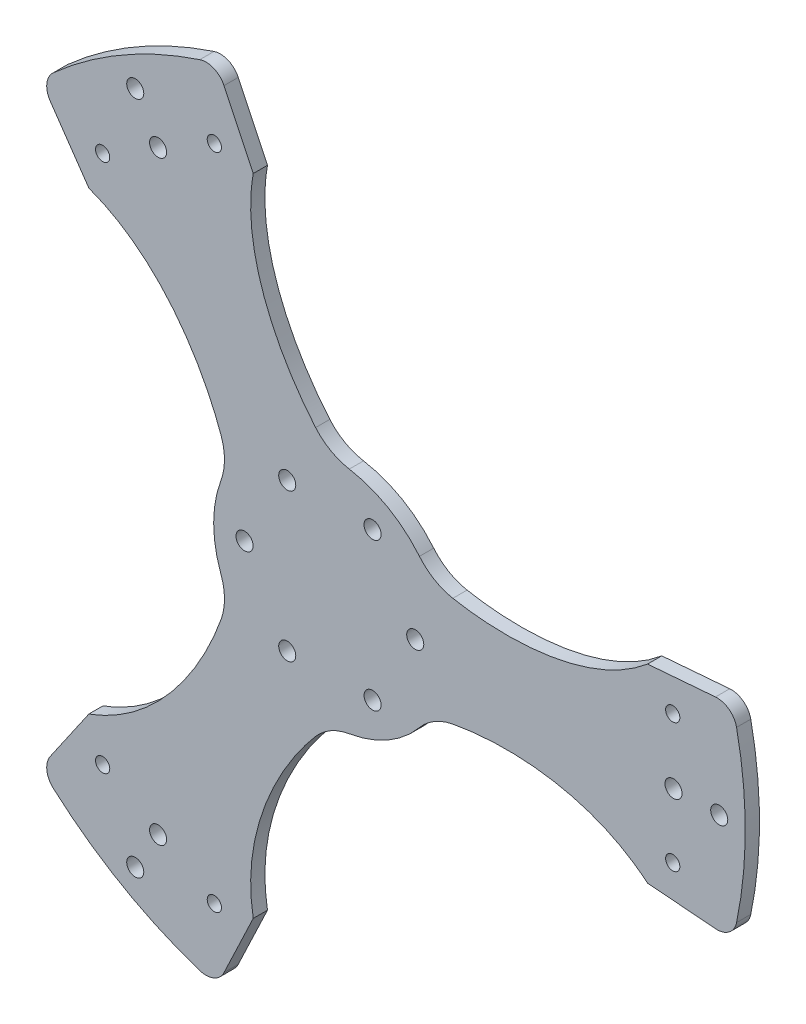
ISO-10303-21;
HEADER;
FILE_DESCRIPTION(('STEP AP214'),'2;1');
FILE_NAME('part.step','',(''),(''),'','','');
FILE_SCHEMA(('AUTOMOTIVE_DESIGN { 1 0 10303 214 1 1 1 1 }'));
ENDSEC;
DATA;
#1=APPLICATION_CONTEXT('core data for automotive mechanical design processes');
#2=APPLICATION_PROTOCOL_DEFINITION('international standard','automotive_design',2000,#1);
#3=PRODUCT_CONTEXT('',#1,'mechanical');
#4=PRODUCT('Part','Part','',(#3));
#5=PRODUCT_RELATED_PRODUCT_CATEGORY('part','',(#4));
#6=PRODUCT_DEFINITION_FORMATION('','',#4);
#7=PRODUCT_DEFINITION_CONTEXT('part definition',#1,'design');
#8=PRODUCT_DEFINITION('design','',#6,#7);
#9=PRODUCT_DEFINITION_SHAPE('','',#8);
#10=(LENGTH_UNIT() NAMED_UNIT(*) SI_UNIT(.MILLI.,.METRE.));
#11=(NAMED_UNIT(*) PLANE_ANGLE_UNIT() SI_UNIT($,.RADIAN.));
#12=(NAMED_UNIT(*) SI_UNIT($,.STERADIAN.) SOLID_ANGLE_UNIT());
#13=UNCERTAINTY_MEASURE_WITH_UNIT(LENGTH_MEASURE(1.E-05),#10,'distance_accuracy_value','');
#14=(GEOMETRIC_REPRESENTATION_CONTEXT(3) GLOBAL_UNCERTAINTY_ASSIGNED_CONTEXT((#13)) GLOBAL_UNIT_ASSIGNED_CONTEXT((#10,
#11,#12)) REPRESENTATION_CONTEXT('',''));
#15=CARTESIAN_POINT('',(0.,0.,0.));
#16=DIRECTION('',(0.,0.,1.));
#17=DIRECTION('',(1.,0.,0.));
#18=AXIS2_PLACEMENT_3D('',#15,#16,#17);
#19=CARTESIAN_POINT('',(71.9456098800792,17.9035773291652,5.));
#20=DIRECTION('',(0.,0.,1.));
#21=DIRECTION('',(1.,0.,0.));
#22=AXIS2_PLACEMENT_3D('',#19,#20,#21);
#23=PLANE('',#22);
#24=CARTESIAN_POINT('',(-14.9999999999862,25.9807621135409,5.));
#25=DIRECTION('',(0.,0.,1.));
#26=DIRECTION('',(1.,0.,0.));
#27=AXIS2_PLACEMENT_3D('',#24,#25,#26);
#28=CIRCLE('',#27,3.);
#29=CARTESIAN_POINT('',(-11.9999999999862,25.9807621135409,5.));
#30=VERTEX_POINT('',#29);
#31=EDGE_CURVE('E1519',#30,#30,#28,.T.);
#32=ORIENTED_EDGE('',*,*,#31,.F.);
#33=EDGE_LOOP('',(#32));
#34=FACE_BOUND('',#33,.T.);
#35=CARTESIAN_POINT('',(-29.9999999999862,7.76843555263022E-12,5.));
#36=DIRECTION('',(0.,0.,1.));
#37=DIRECTION('',(1.,0.,0.));
#38=AXIS2_PLACEMENT_3D('',#35,#36,#37);
#39=CIRCLE('',#38,3.);
#40=CARTESIAN_POINT('',(-26.9999999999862,7.76843555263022E-12,5.));
#41=VERTEX_POINT('',#40);
#42=EDGE_CURVE('E1521',#41,#41,#39,.T.);
#43=ORIENTED_EDGE('',*,*,#42,.F.);
#44=EDGE_LOOP('',(#43));
#45=FACE_BOUND('',#44,.T.);
#46=CARTESIAN_POINT('',(-14.9999999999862,-25.9807621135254,5.));
#47=DIRECTION('',(0.,0.,1.));
#48=DIRECTION('',(1.,0.,0.));
#49=AXIS2_PLACEMENT_3D('',#46,#47,#48);
#50=CIRCLE('',#49,3.);
#51=CARTESIAN_POINT('',(-11.9999999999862,-25.9807621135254,5.));
#52=VERTEX_POINT('',#51);
#53=EDGE_CURVE('E1525',#52,#52,#50,.T.);
#54=ORIENTED_EDGE('',*,*,#53,.F.);
#55=EDGE_LOOP('',(#54));
#56=FACE_BOUND('',#55,.T.);
#57=CARTESIAN_POINT('',(15.0000000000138,-25.9807621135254,5.));
#58=DIRECTION('',(0.,0.,1.));
#59=DIRECTION('',(1.,0.,0.));
#60=AXIS2_PLACEMENT_3D('',#57,#58,#59);
#61=CIRCLE('',#60,3.);
#62=CARTESIAN_POINT('',(18.0000000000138,-25.9807621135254,5.));
#63=VERTEX_POINT('',#62);
#64=EDGE_CURVE('E1534',#63,#63,#61,.T.);
#65=ORIENTED_EDGE('',*,*,#64,.F.);
#66=EDGE_LOOP('',(#65));
#67=FACE_BOUND('',#66,.T.);
#68=CARTESIAN_POINT('',(30.0000000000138,7.77448229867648E-12,5.));
#69=DIRECTION('',(0.,0.,1.));
#70=DIRECTION('',(1.,0.,0.));
#71=AXIS2_PLACEMENT_3D('',#68,#69,#70);
#72=CIRCLE('',#71,3.);
#73=CARTESIAN_POINT('',(33.0000000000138,7.77448229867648E-12,5.));
#74=VERTEX_POINT('',#73);
#75=EDGE_CURVE('E1530',#74,#74,#72,.T.);
#76=ORIENTED_EDGE('',*,*,#75,.F.);
#77=EDGE_LOOP('',(#76));
#78=FACE_BOUND('',#77,.T.);
#79=CARTESIAN_POINT('',(15.0000000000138,25.9807621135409,5.));
#80=DIRECTION('',(0.,0.,1.));
#81=DIRECTION('',(1.,0.,0.));
#82=AXIS2_PLACEMENT_3D('',#79,#80,#81);
#83=CIRCLE('',#82,3.);
#84=CARTESIAN_POINT('',(18.0000000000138,25.9807621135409,5.));
#85=VERTEX_POINT('',#84);
#86=EDGE_CURVE('E434',#85,#85,#83,.T.);
#87=ORIENTED_EDGE('',*,*,#86,.F.);
#88=EDGE_LOOP('',(#87));
#89=FACE_BOUND('',#88,.T.);
#90=CARTESIAN_POINT('',(-79.8943133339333,-93.0441563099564,5.));
#91=DIRECTION('',(0.,0.,1.));
#92=DIRECTION('',(1.,0.,0.));
#93=AXIS2_PLACEMENT_3D('',#90,#91,#92);
#94=CIRCLE('',#93,2.49999999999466);
#95=CARTESIAN_POINT('',(-77.3943133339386,-93.0441563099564,5.));
#96=VERTEX_POINT('',#95);
#97=EDGE_CURVE('E467',#96,#96,#94,.T.);
#98=ORIENTED_EDGE('',*,*,#97,.F.);
#99=EDGE_LOOP('',(#98));
#100=FACE_BOUND('',#99,.T.);
#101=CARTESIAN_POINT('',(-40.6314463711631,-115.712583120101,5.));
#102=DIRECTION('',(0.,0.,1.));
#103=DIRECTION('',(1.,0.,0.));
#104=AXIS2_PLACEMENT_3D('',#101,#102,#103);
#105=CIRCLE('',#104,2.49999999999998);
#106=CARTESIAN_POINT('',(-38.1314463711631,-115.712583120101,5.));
#107=VERTEX_POINT('',#106);
#108=EDGE_CURVE('E483',#107,#107,#105,.T.);
#109=ORIENTED_EDGE('',*,*,#108,.F.);
#110=EDGE_LOOP('',(#109));
#111=FACE_BOUND('',#110,.T.);
#112=CARTESIAN_POINT('',(120.525759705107,-22.6684268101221,5.));
#113=DIRECTION('',(0.,0.,1.));
#114=DIRECTION('',(1.,0.,0.));
#115=AXIS2_PLACEMENT_3D('',#112,#113,#114);
#116=CIRCLE('',#115,2.49999999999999);
#117=CARTESIAN_POINT('',(123.025759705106,-22.6684268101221,5.));
#118=VERTEX_POINT('',#117);
#119=EDGE_CURVE('E499',#118,#118,#116,.T.);
#120=ORIENTED_EDGE('',*,*,#119,.F.);
#121=EDGE_LOOP('',(#120));
#122=FACE_BOUND('',#121,.T.);
#123=CARTESIAN_POINT('',(120.525759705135,22.6684268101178,5.));
#124=DIRECTION('',(0.,0.,1.));
#125=DIRECTION('',(1.,0.,0.));
#126=AXIS2_PLACEMENT_3D('',#123,#124,#125);
#127=CIRCLE('',#126,2.50000000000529);
#128=CARTESIAN_POINT('',(123.02575970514,22.6684268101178,5.));
#129=VERTEX_POINT('',#128);
#130=EDGE_CURVE('E515',#129,#129,#127,.T.);
#131=ORIENTED_EDGE('',*,*,#130,.F.);
#132=EDGE_LOOP('',(#131));
#133=FACE_BOUND('',#132,.T.);
#134=CARTESIAN_POINT('',(-40.6314463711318,115.712583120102,5.));
#135=DIRECTION('',(0.,0.,1.));
#136=DIRECTION('',(1.,0.,0.));
#137=AXIS2_PLACEMENT_3D('',#134,#135,#136);
#138=CIRCLE('',#137,2.49999999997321);
#139=CARTESIAN_POINT('',(-38.1314463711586,115.712583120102,5.));
#140=VERTEX_POINT('',#139);
#141=EDGE_CURVE('E531',#140,#140,#138,.T.);
#142=ORIENTED_EDGE('',*,*,#141,.F.);
#143=EDGE_LOOP('',(#142));
#144=FACE_BOUND('',#143,.T.);
#145=CARTESIAN_POINT('',(-79.8943133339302,93.0441563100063,5.));
#146=DIRECTION('',(0.,0.,1.));
#147=DIRECTION('',(1.,0.,0.));
#148=AXIS2_PLACEMENT_3D('',#145,#146,#147);
#149=CIRCLE('',#148,2.49999999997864);
#150=CARTESIAN_POINT('',(-77.3943133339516,93.0441563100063,5.));
#151=VERTEX_POINT('',#150);
#152=EDGE_CURVE('E547',#151,#151,#149,.T.);
#153=ORIENTED_EDGE('',*,*,#152,.F.);
#154=EDGE_LOOP('',(#153));
#155=FACE_BOUND('',#154,.T.);
#156=CARTESIAN_POINT('',(-84.7259079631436,-80.0386194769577,5.));
#157=CARTESIAN_POINT('',(-101.756794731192,-104.726907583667,5.));
#158=B_SPLINE_CURVE_WITH_KNOTS('',1,(#156,#157),.UNSPECIFIED.,.F.,.F.,(2,2),(0.,1.),.UNSPECIFIED.);
#159=CARTESIAN_POINT('',(-84.7259079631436,-80.0386194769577,5.));
#160=VERTEX_POINT('',#159);
#161=CARTESIAN_POINT('',(-98.3243512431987,-99.7511740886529,5.));
#162=VERTEX_POINT('',#161);
#163=EDGE_CURVE('E838',#160,#162,#158,.T.);
#164=ORIENTED_EDGE('',*,*,#163,.T.);
#165=CARTESIAN_POINT('',(-92.5623505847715,-103.726013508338,5.));
#166=DIRECTION('',(0.,0.,1.));
#167=DIRECTION('',(1.,0.,0.));
#168=AXIS2_PLACEMENT_3D('',#165,#166,#167);
#169=CIRCLE('',#168,7.);
#170=CARTESIAN_POINT('',(-97.2230554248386,-108.948831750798,5.));
#171=VERTEX_POINT('',#170);
#172=EDGE_CURVE('E401',#162,#171,#169,.T.);
#173=ORIENTED_EDGE('',*,*,#172,.T.);
#174=CARTESIAN_POINT('',(1.37806432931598E-11,7.7715611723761E-12,5.));
#175=DIRECTION('',(0.,0.,1.));
#176=DIRECTION('',(1.,0.,0.));
#177=AXIS2_PLACEMENT_3D('',#174,#175,#176);
#178=CIRCLE('',#177,146.021130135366);
#179=CARTESIAN_POINT('',(-45.7409282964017,-138.672051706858,5.));
#180=VERTEX_POINT('',#179);
#181=EDGE_CURVE('E953',#171,#180,#178,.T.);
#182=ORIENTED_EDGE('',*,*,#181,.T.);
#183=CARTESIAN_POINT('',(-43.5481874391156,-132.024353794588,5.));
#184=DIRECTION('',(0.,0.,1.));
#185=DIRECTION('',(1.,0.,0.));
#186=AXIS2_PLACEMENT_3D('',#183,#184,#185);
#187=CIRCLE('',#186,7.);
#188=CARTESIAN_POINT('',(-37.224875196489,-135.026973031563,5.));
#189=VERTEX_POINT('',#188);
#190=EDGE_CURVE('E398',#180,#189,#187,.T.);
#191=ORIENTED_EDGE('',*,*,#190,.T.);
#192=CARTESIAN_POINT('',(-39.8177650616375,-140.487423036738,5.));
#193=CARTESIAN_POINT('',(-26.9525237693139,-113.394098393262,5.));
#194=B_SPLINE_CURVE_WITH_KNOTS('',1,(#192,#193),.UNSPECIFIED.,.F.,.F.,(2,2),(0.,1.),.UNSPECIFIED.);
#195=CARTESIAN_POINT('',(-26.9525237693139,-113.394098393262,5.));
#196=VERTEX_POINT('',#195);
#197=EDGE_CURVE('E950',#189,#196,#194,.T.);
#198=ORIENTED_EDGE('',*,*,#197,.T.);
#199=CARTESIAN_POINT('',(-26.9525237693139,-113.394098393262,5.));
#200=CARTESIAN_POINT('',(-32.1783724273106,-83.9885676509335,5.));
#201=CARTESIAN_POINT('',(-13.6774354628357,-54.6146197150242,5.));
#202=CARTESIAN_POINT('',(0.777130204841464,-40.8644556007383,5.));
#203=B_SPLINE_CURVE_WITH_KNOTS('',3,(#199,#200,#201,#202),.UNSPECIFIED.,.F.,.F.,(4,4),(0.,1.),.UNSPECIFIED.);
#204=CARTESIAN_POINT('',(-5.02423456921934,-47.0081800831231,5.));
#205=VERTEX_POINT('',#204);
#206=EDGE_CURVE('E948',#196,#205,#203,.T.);
#207=ORIENTED_EDGE('',*,*,#206,.T.);
#208=CARTESIAN_POINT('',(10.16710750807,-60.0167590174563,5.));
#209=DIRECTION('',(0.,0.,1.));
#210=DIRECTION('',(1.,0.,0.));
#211=AXIS2_PLACEMENT_3D('',#208,#209,#210);
#212=CIRCLE('',#211,20.);
#213=CARTESIAN_POINT('',(6.82661154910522,-40.2977051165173,5.));
#214=VERTEX_POINT('',#213);
#215=EDGE_CURVE('E333',#205,#214,#212,.F.);
#216=ORIENTED_EDGE('',*,*,#215,.T.);
#217=CARTESIAN_POINT('',(1.37806432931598E-11,7.7715611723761E-12,5.));
#218=DIRECTION('',(0.,0.,1.));
#219=DIRECTION('',(1.,0.,0.));
#220=AXIS2_PLACEMENT_3D('',#217,#218,#219);
#221=CIRCLE('',#220,40.8718443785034);
#222=CARTESIAN_POINT('',(31.4855305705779,-26.0608715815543,5.));
#223=VERTEX_POINT('',#222);
#224=EDGE_CURVE('E659',#214,#223,#221,.T.);
#225=ORIENTED_EDGE('',*,*,#224,.T.);
#226=CARTESIAN_POINT('',(46.892484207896,-38.8133528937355,5.));
#227=DIRECTION('',(0.,0.,1.));
#228=DIRECTION('',(1.,0.,0.));
#229=AXIS2_PLACEMENT_3D('',#226,#227,#228);
#230=CIRCLE('',#229,20.);
#231=CARTESIAN_POINT('',(43.2223954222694,-19.1529752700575,5.));
#232=VERTEX_POINT('',#231);
#233=EDGE_CURVE('E327',#223,#232,#230,.F.);
#234=ORIENTED_EDGE('',*,*,#233,.T.);
#235=CARTESIAN_POINT('',(35.0010915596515,-21.1052422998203,5.));
#236=CARTESIAN_POINT('',(54.136365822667,-15.4623032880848,5.));
#237=CARTESIAN_POINT('',(88.8254194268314,-14.1269958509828,5.));
#238=CARTESIAN_POINT('',(111.678431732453,-33.3554789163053,5.));
#239=B_SPLINE_CURVE_WITH_KNOTS('',3,(#235,#236,#237,#238),.UNSPECIFIED.,.F.,.F.,(4,4),(0.,1.),.UNSPECIFIED.);
#240=CARTESIAN_POINT('',(111.678431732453,-33.3554789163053,5.));
#241=VERTEX_POINT('',#240);
#242=EDGE_CURVE('E651',#232,#241,#239,.T.);
#243=ORIENTED_EDGE('',*,*,#242,.T.);
#244=CARTESIAN_POINT('',(111.678431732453,-33.3554789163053,5.));
#245=CARTESIAN_POINT('',(141.574559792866,-35.7605154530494,5.));
#246=B_SPLINE_CURVE_WITH_KNOTS('',1,(#244,#245),.UNSPECIFIED.,.F.,.F.,(2,2),(0.,1.),.UNSPECIFIED.);
#247=CARTESIAN_POINT('',(135.549226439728,-35.2757989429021,5.));
#248=VERTEX_POINT('',#247);
#249=EDGE_CURVE('E658',#241,#248,#246,.T.);
#250=ORIENTED_EDGE('',*,*,#249,.T.);
#251=CARTESIAN_POINT('',(136.110538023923,-28.2983402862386,5.));
#252=DIRECTION('',(0.,0.,1.));
#253=DIRECTION('',(1.,0.,0.));
#254=AXIS2_PLACEMENT_3D('',#251,#252,#253);
#255=CIRCLE('',#254,7.);
#256=CARTESIAN_POINT('',(142.963983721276,-29.7232199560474,5.));
#257=VERTEX_POINT('',#256);
#258=EDGE_CURVE('E69',#248,#257,#255,.T.);
#259=ORIENTED_EDGE('',*,*,#258,.T.);
#260=CARTESIAN_POINT('',(1.37806432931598E-11,7.7715611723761E-12,5.));
#261=DIRECTION('',(0.,0.,1.));
#262=DIRECTION('',(1.,0.,0.));
#263=AXIS2_PLACEMENT_3D('',#260,#261,#262);
#264=CIRCLE('',#263,146.021130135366);
#265=CARTESIAN_POINT('',(142.963983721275,29.7232199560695,5.));
#266=VERTEX_POINT('',#265);
#267=EDGE_CURVE('E668',#257,#266,#264,.T.);
#268=ORIENTED_EDGE('',*,*,#267,.T.);
#269=CARTESIAN_POINT('',(136.110538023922,28.2983402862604,5.));
#270=DIRECTION('',(0.,0.,1.));
#271=DIRECTION('',(1.,0.,0.));
#272=AXIS2_PLACEMENT_3D('',#269,#270,#271);
#273=CIRCLE('',#272,7.);
#274=CARTESIAN_POINT('',(135.549226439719,35.2757989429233,5.));
#275=VERTEX_POINT('',#274);
#276=EDGE_CURVE('E252',#266,#275,#273,.T.);
#277=ORIENTED_EDGE('',*,*,#276,.T.);
#278=CARTESIAN_POINT('',(141.57455979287,35.7605154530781,5.));
#279=CARTESIAN_POINT('',(111.678431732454,33.3554789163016,5.));
#280=B_SPLINE_CURVE_WITH_KNOTS('',1,(#278,#279),.UNSPECIFIED.,.F.,.F.,(2,2),(0.,1.),.UNSPECIFIED.);
#281=CARTESIAN_POINT('',(111.678431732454,33.3554789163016,5.));
#282=VERTEX_POINT('',#281);
#283=EDGE_CURVE('E245',#275,#282,#280,.T.);
#284=ORIENTED_EDGE('',*,*,#283,.T.);
#285=CARTESIAN_POINT('',(111.678431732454,33.3554789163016,5.));
#286=CARTESIAN_POINT('',(88.8254194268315,14.1269958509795,5.));
#287=CARTESIAN_POINT('',(54.1363658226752,15.4623032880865,5.));
#288=CARTESIAN_POINT('',(35.0010915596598,21.1052422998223,5.));
#289=B_SPLINE_CURVE_WITH_KNOTS('',3,(#285,#286,#287,#288),.UNSPECIFIED.,.F.,.F.,(4,4),(0.,1.),.UNSPECIFIED.);
#290=CARTESIAN_POINT('',(43.2223954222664,19.1529752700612,5.));
#291=VERTEX_POINT('',#290);
#292=EDGE_CURVE('E249',#282,#291,#289,.T.);
#293=ORIENTED_EDGE('',*,*,#292,.T.);
#294=CARTESIAN_POINT('',(46.8924842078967,38.8133528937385,5.));
#295=DIRECTION('',(0.,0.,1.));
#296=DIRECTION('',(1.,0.,0.));
#297=AXIS2_PLACEMENT_3D('',#294,#295,#296);
#298=CIRCLE('',#297,20.);
#299=CARTESIAN_POINT('',(31.4855305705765,26.0608715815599,5.));
#300=VERTEX_POINT('',#299);
#301=EDGE_CURVE('E345',#291,#300,#298,.F.);
#302=ORIENTED_EDGE('',*,*,#301,.T.);
#303=CARTESIAN_POINT('',(1.37806432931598E-11,7.7715611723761E-12,5.));
#304=DIRECTION('',(0.,0.,1.));
#305=DIRECTION('',(1.,0.,0.));
#306=AXIS2_PLACEMENT_3D('',#303,#304,#305);
#307=CIRCLE('',#306,40.8718443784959);
#308=CARTESIAN_POINT('',(6.82661154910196,40.2977051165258,5.));
#309=VERTEX_POINT('',#308);
#310=EDGE_CURVE('E268',#300,#309,#307,.T.);
#311=ORIENTED_EDGE('',*,*,#310,.T.);
#312=CARTESIAN_POINT('',(10.1671075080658,60.016759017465,5.));
#313=DIRECTION('',(0.,0.,1.));
#314=DIRECTION('',(1.,0.,0.));
#315=AXIS2_PLACEMENT_3D('',#312,#313,#314);
#316=CIRCLE('',#315,20.);
#317=CARTESIAN_POINT('',(-5.02423456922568,47.0081800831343,5.));
#318=VERTEX_POINT('',#317);
#319=EDGE_CURVE('E339',#309,#318,#316,.F.);
#320=ORIENTED_EDGE('',*,*,#319,.T.);
#321=CARTESIAN_POINT('',(0.777130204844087,40.8644556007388,5.));
#322=CARTESIAN_POINT('',(-13.677435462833,54.6146197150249,5.));
#323=CARTESIAN_POINT('',(-32.1783724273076,83.9885676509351,5.));
#324=CARTESIAN_POINT('',(-26.9525237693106,113.394098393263,5.));
#325=B_SPLINE_CURVE_WITH_KNOTS('',3,(#321,#322,#323,#324),.UNSPECIFIED.,.F.,.F.,(4,4),(0.,1.),.UNSPECIFIED.);
#326=CARTESIAN_POINT('',(-26.9525237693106,113.394098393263,5.));
#327=VERTEX_POINT('',#326);
#328=EDGE_CURVE('E881',#318,#327,#325,.T.);
#329=ORIENTED_EDGE('',*,*,#328,.T.);
#330=CARTESIAN_POINT('',(-26.9525237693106,113.394098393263,5.));
#331=CARTESIAN_POINT('',(-39.8177650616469,140.487423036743,5.));
#332=B_SPLINE_CURVE_WITH_KNOTS('',1,(#330,#331),.UNSPECIFIED.,.F.,.F.,(2,2),(0.,1.),.UNSPECIFIED.);
#333=CARTESIAN_POINT('',(-37.2248751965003,135.026973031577,5.));
#334=VERTEX_POINT('',#333);
#335=EDGE_CURVE('E887',#327,#334,#332,.T.);
#336=ORIENTED_EDGE('',*,*,#335,.T.);
#337=CARTESIAN_POINT('',(-43.5481874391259,132.024353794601,5.));
#338=DIRECTION('',(0.,0.,1.));
#339=DIRECTION('',(1.,0.,0.));
#340=AXIS2_PLACEMENT_3D('',#337,#338,#339);
#341=CIRCLE('',#340,7.);
#342=CARTESIAN_POINT('',(-45.7409282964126,138.67205170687,5.));
#343=VERTEX_POINT('',#342);
#344=EDGE_CURVE('E391',#334,#343,#341,.T.);
#345=ORIENTED_EDGE('',*,*,#344,.T.);
#346=CARTESIAN_POINT('',(1.37806432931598E-11,7.7715611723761E-12,5.));
#347=DIRECTION('',(0.,0.,1.));
#348=DIRECTION('',(1.,0.,0.));
#349=AXIS2_PLACEMENT_3D('',#346,#347,#348);
#350=CIRCLE('',#349,146.021130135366);
#351=CARTESIAN_POINT('',(-97.2230554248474,108.948831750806,5.));
#352=VERTEX_POINT('',#351);
#353=EDGE_CURVE('E896',#343,#352,#350,.T.);
#354=ORIENTED_EDGE('',*,*,#353,.T.);
#355=CARTESIAN_POINT('',(-92.5623505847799,103.726013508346,5.));
#356=DIRECTION('',(0.,0.,1.));
#357=DIRECTION('',(1.,0.,0.));
#358=AXIS2_PLACEMENT_3D('',#355,#356,#357);
#359=CIRCLE('',#358,7.);
#360=CARTESIAN_POINT('',(-98.3243512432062,99.7511740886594,5.));
#361=VERTEX_POINT('',#360);
#362=EDGE_CURVE('E388',#352,#361,#359,.T.);
#363=ORIENTED_EDGE('',*,*,#362,.T.);
#364=CARTESIAN_POINT('',(-101.756794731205,104.72690758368,5.));
#365=CARTESIAN_POINT('',(-84.7259079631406,80.0386194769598,5.));
#366=B_SPLINE_CURVE_WITH_KNOTS('',1,(#364,#365),.UNSPECIFIED.,.F.,.F.,(2,2),(0.,1.),.UNSPECIFIED.);
#367=CARTESIAN_POINT('',(-84.7259079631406,80.0386194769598,5.));
#368=VERTEX_POINT('',#367);
#369=EDGE_CURVE('E840',#361,#368,#366,.T.);
#370=ORIENTED_EDGE('',*,*,#369,.T.);
#371=CARTESIAN_POINT('',(-84.7259079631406,80.0386194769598,5.));
#372=CARTESIAN_POINT('',(-56.6470469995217,69.8615717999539,5.));
#373=CARTESIAN_POINT('',(-40.4589303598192,39.1523164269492,5.));
#374=CARTESIAN_POINT('',(-35.7782217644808,19.7592133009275,5.));
#375=B_SPLINE_CURVE_WITH_KNOTS('',3,(#371,#372,#373,#374),.UNSPECIFIED.,.F.,.F.,(4,4),(0.,1.),.UNSPECIFIED.);
#376=CARTESIAN_POINT('',(-38.1981608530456,27.8552048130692,5.));
#377=VERTEX_POINT('',#376);
#378=EDGE_CURVE('E816',#368,#377,#375,.T.);
#379=ORIENTED_EDGE('',*,*,#378,.T.);
#380=CARTESIAN_POINT('',(-57.0595917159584,21.2034061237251,5.));
#381=DIRECTION('',(0.,0.,1.));
#382=DIRECTION('',(1.,0.,0.));
#383=AXIS2_PLACEMENT_3D('',#380,#381,#382);
#384=CIRCLE('',#383,20.);
#385=CARTESIAN_POINT('',(-38.3121421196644,14.2368335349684,5.));
#386=VERTEX_POINT('',#385);
#387=EDGE_CURVE('E357',#377,#386,#384,.F.);
#388=ORIENTED_EDGE('',*,*,#387,.T.);
#389=CARTESIAN_POINT('',(1.37806432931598E-11,7.7715611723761E-12,5.));
#390=DIRECTION('',(0.,0.,1.));
#391=DIRECTION('',(1.,0.,0.));
#392=AXIS2_PLACEMENT_3D('',#389,#390,#391);
#393=CIRCLE('',#392,40.8718443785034);
#394=CARTESIAN_POINT('',(-38.3121421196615,-14.2368335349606,5.));
#395=VERTEX_POINT('',#394);
#396=EDGE_CURVE('E831',#386,#395,#393,.T.);
#397=ORIENTED_EDGE('',*,*,#396,.T.);
#398=CARTESIAN_POINT('',(-57.0595917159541,-21.2034061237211,5.));
#399=DIRECTION('',(0.,0.,1.));
#400=DIRECTION('',(1.,0.,0.));
#401=AXIS2_PLACEMENT_3D('',#398,#399,#400);
#402=CIRCLE('',#401,20.);
#403=CARTESIAN_POINT('',(-38.1981608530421,-27.8552048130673,5.));
#404=VERTEX_POINT('',#403);
#405=EDGE_CURVE('E351',#395,#404,#402,.F.);
#406=ORIENTED_EDGE('',*,*,#405,.T.);
#407=CARTESIAN_POINT('',(-35.7782217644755,-19.7592133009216,5.));
#408=CARTESIAN_POINT('',(-40.4589303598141,-39.1523164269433,5.));
#409=CARTESIAN_POINT('',(-56.6470469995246,-69.8615717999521,5.));
#410=CARTESIAN_POINT('',(-84.7259079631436,-80.0386194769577,5.));
#411=B_SPLINE_CURVE_WITH_KNOTS('',3,(#407,#408,#409,#410),.UNSPECIFIED.,.F.,.F.,(4,4),(0.,1.),.UNSPECIFIED.);
#412=EDGE_CURVE('E834',#404,#160,#411,.T.);
#413=ORIENTED_EDGE('',*,*,#412,.T.);
#414=EDGE_LOOP('',(#164,#173,#182,#191,#198,#207,#216,#225,#234,#243,#250,#259,#268,#277,#284,
#293,#302,#311,#320,#329,#336,#345,#354,#363,#370,#379,#388,#397,#406,#413));
#415=FACE_BOUND('',#414,.T.);
#416=CARTESIAN_POINT('',(-68.4351140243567,118.533094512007,5.));
#417=DIRECTION('',(0.,0.,1.));
#418=DIRECTION('',(1.,0.,0.));
#419=AXIS2_PLACEMENT_3D('',#416,#417,#418);
#420=CIRCLE('',#419,2.99999999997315);
#421=CARTESIAN_POINT('',(-65.4351140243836,118.533094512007,5.));
#422=VERTEX_POINT('',#421);
#423=EDGE_CURVE('E539',#422,#422,#420,.T.);
#424=ORIENTED_EDGE('',*,*,#423,.F.);
#425=EDGE_LOOP('',(#424));
#426=FACE_BOUND('',#425,.T.);
#427=CARTESIAN_POINT('',(-60.398124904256,104.612621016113,5.));
#428=DIRECTION('',(0.,0.,1.));
#429=DIRECTION('',(1.,0.,0.));
#430=AXIS2_PLACEMENT_3D('',#427,#428,#429);
#431=CIRCLE('',#430,2.99999999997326);
#432=CARTESIAN_POINT('',(-57.3981249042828,104.612621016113,5.));
#433=VERTEX_POINT('',#432);
#434=EDGE_CURVE('E523',#433,#433,#431,.T.);
#435=ORIENTED_EDGE('',*,*,#434,.F.);
#436=EDGE_LOOP('',(#435));
#437=FACE_BOUND('',#436,.T.);
#438=CARTESIAN_POINT('',(136.870228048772,-1.88737914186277E-12,5.));
#439=DIRECTION('',(0.,0.,1.));
#440=DIRECTION('',(1.,0.,0.));
#441=AXIS2_PLACEMENT_3D('',#438,#439,#440);
#442=CIRCLE('',#441,3.);
#443=CARTESIAN_POINT('',(139.870228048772,-1.88737914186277E-12,5.));
#444=VERTEX_POINT('',#443);
#445=EDGE_CURVE('E507',#444,#444,#442,.T.);
#446=ORIENTED_EDGE('',*,*,#445,.F.);
#447=EDGE_LOOP('',(#446));
#448=FACE_BOUND('',#447,.T.);
#449=CARTESIAN_POINT('',(120.79624980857,-1.66533453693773E-12,5.));
#450=DIRECTION('',(0.,0.,1.));
#451=DIRECTION('',(1.,0.,0.));
#452=AXIS2_PLACEMENT_3D('',#449,#450,#451);
#453=CIRCLE('',#452,3.00000000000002);
#454=CARTESIAN_POINT('',(123.79624980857,-1.66533453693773E-12,5.));
#455=VERTEX_POINT('',#454);
#456=EDGE_CURVE('E491',#455,#455,#453,.T.);
#457=ORIENTED_EDGE('',*,*,#456,.F.);
#458=EDGE_LOOP('',(#457));
#459=FACE_BOUND('',#458,.T.);
#460=CARTESIAN_POINT('',(-68.4351140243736,-118.533094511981,5.));
#461=DIRECTION('',(0.,0.,1.));
#462=DIRECTION('',(1.,0.,0.));
#463=AXIS2_PLACEMENT_3D('',#460,#461,#462);
#464=CIRCLE('',#463,2.99999999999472);
#465=CARTESIAN_POINT('',(-65.4351140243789,-118.533094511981,5.));
#466=VERTEX_POINT('',#465);
#467=EDGE_CURVE('E475',#466,#466,#464,.T.);
#468=ORIENTED_EDGE('',*,*,#467,.F.);
#469=EDGE_LOOP('',(#468));
#470=FACE_BOUND('',#469,.T.);
#471=CARTESIAN_POINT('',(-60.3981249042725,-104.612621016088,5.));
#472=DIRECTION('',(0.,0.,1.));
#473=DIRECTION('',(1.,0.,0.));
#474=AXIS2_PLACEMENT_3D('',#471,#472,#473);
#475=CIRCLE('',#474,2.99999999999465);
#476=CARTESIAN_POINT('',(-57.3981249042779,-104.612621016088,5.));
#477=VERTEX_POINT('',#476);
#478=EDGE_CURVE('E457',#477,#477,#475,.T.);
#479=ORIENTED_EDGE('',*,*,#478,.F.);
#480=EDGE_LOOP('',(#479));
#481=FACE_BOUND('',#480,.T.);
#482=ADVANCED_FACE('F44',(#34,#45,#56,#67,#78,#89,#100,#111,#122,#133,#144,#155,#415,#426,#437,
#448,#459,#470,#481),#23,.T.);
#483=CARTESIAN_POINT('',(71.9456098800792,17.9035773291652,0.));
#484=DIRECTION('',(0.,0.,1.));
#485=DIRECTION('',(1.,0.,0.));
#486=AXIS2_PLACEMENT_3D('',#483,#484,#485);
#487=PLANE('',#486);
#488=CARTESIAN_POINT('',(-14.9999999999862,25.9807621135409,0.));
#489=DIRECTION('',(0.,0.,1.));
#490=DIRECTION('',(1.,0.,0.));
#491=AXIS2_PLACEMENT_3D('',#488,#489,#490);
#492=CIRCLE('',#491,3.);
#493=CARTESIAN_POINT('',(-11.9999999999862,25.9807621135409,0.));
#494=VERTEX_POINT('',#493);
#495=EDGE_CURVE('E48',#494,#494,#492,.T.);
#496=ORIENTED_EDGE('',*,*,#495,.T.);
#497=EDGE_LOOP('',(#496));
#498=FACE_BOUND('',#497,.T.);
#499=CARTESIAN_POINT('',(-29.9999999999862,7.76843555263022E-12,0.));
#500=DIRECTION('',(0.,0.,1.));
#501=DIRECTION('',(1.,0.,0.));
#502=AXIS2_PLACEMENT_3D('',#499,#500,#501);
#503=CIRCLE('',#502,3.);
#504=CARTESIAN_POINT('',(-26.9999999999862,7.76843555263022E-12,0.));
#505=VERTEX_POINT('',#504);
#506=EDGE_CURVE('E445',#505,#505,#503,.T.);
#507=ORIENTED_EDGE('',*,*,#506,.T.);
#508=EDGE_LOOP('',(#507));
#509=FACE_BOUND('',#508,.T.);
#510=CARTESIAN_POINT('',(-14.9999999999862,-25.9807621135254,0.));
#511=DIRECTION('',(0.,0.,1.));
#512=DIRECTION('',(1.,0.,0.));
#513=AXIS2_PLACEMENT_3D('',#510,#511,#512);
#514=CIRCLE('',#513,3.);
#515=CARTESIAN_POINT('',(-11.9999999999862,-25.9807621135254,0.));
#516=VERTEX_POINT('',#515);
#517=EDGE_CURVE('E442',#516,#516,#514,.T.);
#518=ORIENTED_EDGE('',*,*,#517,.T.);
#519=EDGE_LOOP('',(#518));
#520=FACE_BOUND('',#519,.T.);
#521=CARTESIAN_POINT('',(15.0000000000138,-25.9807621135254,0.));
#522=DIRECTION('',(0.,0.,1.));
#523=DIRECTION('',(1.,0.,0.));
#524=AXIS2_PLACEMENT_3D('',#521,#522,#523);
#525=CIRCLE('',#524,3.);
#526=CARTESIAN_POINT('',(18.0000000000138,-25.9807621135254,0.));
#527=VERTEX_POINT('',#526);
#528=EDGE_CURVE('E438',#527,#527,#525,.T.);
#529=ORIENTED_EDGE('',*,*,#528,.T.);
#530=EDGE_LOOP('',(#529));
#531=FACE_BOUND('',#530,.T.);
#532=CARTESIAN_POINT('',(30.0000000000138,7.77448229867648E-12,0.));
#533=DIRECTION('',(0.,0.,1.));
#534=DIRECTION('',(1.,0.,0.));
#535=AXIS2_PLACEMENT_3D('',#532,#533,#534);
#536=CIRCLE('',#535,3.);
#537=CARTESIAN_POINT('',(33.0000000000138,7.77448229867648E-12,0.));
#538=VERTEX_POINT('',#537);
#539=EDGE_CURVE('E433',#538,#538,#536,.T.);
#540=ORIENTED_EDGE('',*,*,#539,.T.);
#541=EDGE_LOOP('',(#540));
#542=FACE_BOUND('',#541,.T.);
#543=CARTESIAN_POINT('',(15.0000000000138,25.9807621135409,0.));
#544=DIRECTION('',(0.,0.,1.));
#545=DIRECTION('',(1.,0.,0.));
#546=AXIS2_PLACEMENT_3D('',#543,#544,#545);
#547=CIRCLE('',#546,3.);
#548=CARTESIAN_POINT('',(18.0000000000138,25.9807621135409,0.));
#549=VERTEX_POINT('',#548);
#550=EDGE_CURVE('E429',#549,#549,#547,.T.);
#551=ORIENTED_EDGE('',*,*,#550,.T.);
#552=EDGE_LOOP('',(#551));
#553=FACE_BOUND('',#552,.T.);
#554=CARTESIAN_POINT('',(1.37806432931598E-11,7.7715611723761E-12,0.));
#555=DIRECTION('',(0.,0.,1.));
#556=DIRECTION('',(1.,0.,0.));
#557=AXIS2_PLACEMENT_3D('',#554,#555,#556);
#558=CIRCLE('',#557,146.021130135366);
#559=CARTESIAN_POINT('',(-97.2230554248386,-108.948831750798,0.));
#560=VERTEX_POINT('',#559);
#561=CARTESIAN_POINT('',(-45.7409282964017,-138.672051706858,0.));
#562=VERTEX_POINT('',#561);
#563=EDGE_CURVE('E750',#560,#562,#558,.T.);
#564=ORIENTED_EDGE('',*,*,#563,.F.);
#565=CARTESIAN_POINT('',(-92.5623505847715,-103.726013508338,0.));
#566=DIRECTION('',(0.,0.,1.));
#567=DIRECTION('',(1.,0.,0.));
#568=AXIS2_PLACEMENT_3D('',#565,#566,#567);
#569=CIRCLE('',#568,7.);
#570=CARTESIAN_POINT('',(-98.3243512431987,-99.7511740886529,0.));
#571=VERTEX_POINT('',#570);
#572=EDGE_CURVE('E382',#560,#571,#569,.F.);
#573=ORIENTED_EDGE('',*,*,#572,.T.);
#574=CARTESIAN_POINT('',(-84.7259079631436,-80.0386194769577,0.));
#575=CARTESIAN_POINT('',(-101.756794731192,-104.726907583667,0.));
#576=B_SPLINE_CURVE_WITH_KNOTS('',1,(#574,#575),.UNSPECIFIED.,.F.,.F.,(2,2),(0.,1.),.UNSPECIFIED.);
#577=CARTESIAN_POINT('',(-84.7259079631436,-80.0386194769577,0.));
#578=VERTEX_POINT('',#577);
#579=EDGE_CURVE('E741',#578,#571,#576,.T.);
#580=ORIENTED_EDGE('',*,*,#579,.F.);
#581=CARTESIAN_POINT('',(-35.7782217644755,-19.7592133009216,0.));
#582=CARTESIAN_POINT('',(-40.4589303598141,-39.1523164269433,0.));
#583=CARTESIAN_POINT('',(-56.6470469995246,-69.8615717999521,0.));
#584=CARTESIAN_POINT('',(-84.7259079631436,-80.0386194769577,0.));
#585=B_SPLINE_CURVE_WITH_KNOTS('',3,(#581,#582,#583,#584),.UNSPECIFIED.,.F.,.F.,(4,4),(0.,1.),.UNSPECIFIED.);
#586=CARTESIAN_POINT('',(-38.1981608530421,-27.8552048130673,0.));
#587=VERTEX_POINT('',#586);
#588=EDGE_CURVE('E736',#587,#578,#585,.T.);
#589=ORIENTED_EDGE('',*,*,#588,.F.);
#590=CARTESIAN_POINT('',(-57.0595917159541,-21.2034061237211,0.));
#591=DIRECTION('',(0.,0.,1.));
#592=DIRECTION('',(1.,0.,0.));
#593=AXIS2_PLACEMENT_3D('',#590,#591,#592);
#594=CIRCLE('',#593,20.);
#595=CARTESIAN_POINT('',(-38.3121421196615,-14.2368335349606,0.));
#596=VERTEX_POINT('',#595);
#597=EDGE_CURVE('E348',#587,#596,#594,.T.);
#598=ORIENTED_EDGE('',*,*,#597,.T.);
#599=CARTESIAN_POINT('',(1.37806432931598E-11,7.7715611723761E-12,0.));
#600=DIRECTION('',(0.,0.,1.));
#601=DIRECTION('',(1.,0.,0.));
#602=AXIS2_PLACEMENT_3D('',#599,#600,#601);
#603=CIRCLE('',#602,40.8718443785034);
#604=CARTESIAN_POINT('',(-38.3121421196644,14.2368335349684,0.));
#605=VERTEX_POINT('',#604);
#606=EDGE_CURVE('E729',#605,#596,#603,.T.);
#607=ORIENTED_EDGE('',*,*,#606,.F.);
#608=CARTESIAN_POINT('',(-57.0595917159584,21.2034061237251,0.));
#609=DIRECTION('',(0.,0.,1.));
#610=DIRECTION('',(1.,0.,0.));
#611=AXIS2_PLACEMENT_3D('',#608,#609,#610);
#612=CIRCLE('',#611,20.);
#613=CARTESIAN_POINT('',(-38.1981608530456,27.8552048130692,0.));
#614=VERTEX_POINT('',#613);
#615=EDGE_CURVE('E354',#605,#614,#612,.T.);
#616=ORIENTED_EDGE('',*,*,#615,.T.);
#617=CARTESIAN_POINT('',(-84.7259079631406,80.0386194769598,0.));
#618=CARTESIAN_POINT('',(-56.6470469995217,69.8615717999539,0.));
#619=CARTESIAN_POINT('',(-40.4589303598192,39.1523164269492,0.));
#620=CARTESIAN_POINT('',(-35.7782217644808,19.7592133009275,0.));
#621=B_SPLINE_CURVE_WITH_KNOTS('',3,(#617,#618,#619,#620),.UNSPECIFIED.,.F.,.F.,(4,4),(0.,1.),.UNSPECIFIED.);
#622=CARTESIAN_POINT('',(-84.7259079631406,80.0386194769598,0.));
#623=VERTEX_POINT('',#622);
#624=EDGE_CURVE('E720',#623,#614,#621,.T.);
#625=ORIENTED_EDGE('',*,*,#624,.F.);
#626=CARTESIAN_POINT('',(-101.756794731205,104.72690758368,0.));
#627=CARTESIAN_POINT('',(-84.7259079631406,80.0386194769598,0.));
#628=B_SPLINE_CURVE_WITH_KNOTS('',1,(#626,#627),.UNSPECIFIED.,.F.,.F.,(2,2),(0.,1.),.UNSPECIFIED.);
#629=CARTESIAN_POINT('',(-98.3243512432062,99.7511740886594,0.));
#630=VERTEX_POINT('',#629);
#631=EDGE_CURVE('E715',#630,#623,#628,.T.);
#632=ORIENTED_EDGE('',*,*,#631,.F.);
#633=CARTESIAN_POINT('',(-92.5623505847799,103.726013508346,0.));
#634=DIRECTION('',(0.,0.,1.));
#635=DIRECTION('',(1.,0.,0.));
#636=AXIS2_PLACEMENT_3D('',#633,#634,#635);
#637=CIRCLE('',#636,7.);
#638=CARTESIAN_POINT('',(-97.2230554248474,108.948831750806,0.));
#639=VERTEX_POINT('',#638);
#640=EDGE_CURVE('E367',#630,#639,#637,.F.);
#641=ORIENTED_EDGE('',*,*,#640,.T.);
#642=CARTESIAN_POINT('',(1.37806432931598E-11,7.7715611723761E-12,0.));
#643=DIRECTION('',(0.,0.,1.));
#644=DIRECTION('',(1.,0.,0.));
#645=AXIS2_PLACEMENT_3D('',#642,#643,#644);
#646=CIRCLE('',#645,146.021130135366);
#647=CARTESIAN_POINT('',(-45.7409282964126,138.67205170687,0.));
#648=VERTEX_POINT('',#647);
#649=EDGE_CURVE('E708',#648,#639,#646,.T.);
#650=ORIENTED_EDGE('',*,*,#649,.F.);
#651=CARTESIAN_POINT('',(-43.5481874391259,132.024353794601,0.));
#652=DIRECTION('',(0.,0.,1.));
#653=DIRECTION('',(1.,0.,0.));
#654=AXIS2_PLACEMENT_3D('',#651,#652,#653);
#655=CIRCLE('',#654,7.);
#656=CARTESIAN_POINT('',(-37.2248751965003,135.026973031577,0.));
#657=VERTEX_POINT('',#656);
#658=EDGE_CURVE('E370',#648,#657,#655,.F.);
#659=ORIENTED_EDGE('',*,*,#658,.T.);
#660=CARTESIAN_POINT('',(-26.9525237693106,113.394098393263,0.));
#661=CARTESIAN_POINT('',(-39.8177650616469,140.487423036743,0.));
#662=B_SPLINE_CURVE_WITH_KNOTS('',1,(#660,#661),.UNSPECIFIED.,.F.,.F.,(2,2),(0.,1.),.UNSPECIFIED.);
#663=CARTESIAN_POINT('',(-26.9525237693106,113.394098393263,0.));
#664=VERTEX_POINT('',#663);
#665=EDGE_CURVE('E699',#664,#657,#662,.T.);
#666=ORIENTED_EDGE('',*,*,#665,.F.);
#667=CARTESIAN_POINT('',(0.777130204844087,40.8644556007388,0.));
#668=CARTESIAN_POINT('',(-13.677435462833,54.6146197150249,0.));
#669=CARTESIAN_POINT('',(-32.1783724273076,83.9885676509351,0.));
#670=CARTESIAN_POINT('',(-26.9525237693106,113.394098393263,0.));
#671=B_SPLINE_CURVE_WITH_KNOTS('',3,(#667,#668,#669,#670),.UNSPECIFIED.,.F.,.F.,(4,4),(0.,1.),.UNSPECIFIED.);
#672=CARTESIAN_POINT('',(-5.02423456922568,47.0081800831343,0.));
#673=VERTEX_POINT('',#672);
#674=EDGE_CURVE('E694',#673,#664,#671,.T.);
#675=ORIENTED_EDGE('',*,*,#674,.F.);
#676=CARTESIAN_POINT('',(10.1671075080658,60.016759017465,0.));
#677=DIRECTION('',(0.,0.,1.));
#678=DIRECTION('',(1.,0.,0.));
#679=AXIS2_PLACEMENT_3D('',#676,#677,#678);
#680=CIRCLE('',#679,20.);
#681=CARTESIAN_POINT('',(6.82661154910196,40.2977051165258,0.));
#682=VERTEX_POINT('',#681);
#683=EDGE_CURVE('E336',#673,#682,#680,.T.);
#684=ORIENTED_EDGE('',*,*,#683,.T.);
#685=CARTESIAN_POINT('',(1.37806432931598E-11,7.7715611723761E-12,0.));
#686=DIRECTION('',(0.,0.,1.));
#687=DIRECTION('',(1.,0.,0.));
#688=AXIS2_PLACEMENT_3D('',#685,#686,#687);
#689=CIRCLE('',#688,40.8718443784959);
#690=CARTESIAN_POINT('',(31.4855305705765,26.0608715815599,0.));
#691=VERTEX_POINT('',#690);
#692=EDGE_CURVE('E687',#691,#682,#689,.T.);
#693=ORIENTED_EDGE('',*,*,#692,.F.);
#694=CARTESIAN_POINT('',(46.8924842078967,38.8133528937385,0.));
#695=DIRECTION('',(0.,0.,1.));
#696=DIRECTION('',(1.,0.,0.));
#697=AXIS2_PLACEMENT_3D('',#694,#695,#696);
#698=CIRCLE('',#697,20.);
#699=CARTESIAN_POINT('',(43.2223954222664,19.1529752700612,0.));
#700=VERTEX_POINT('',#699);
#701=EDGE_CURVE('E342',#691,#700,#698,.T.);
#702=ORIENTED_EDGE('',*,*,#701,.T.);
#703=CARTESIAN_POINT('',(111.678431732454,33.3554789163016,0.));
#704=CARTESIAN_POINT('',(88.8254194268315,14.1269958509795,0.));
#705=CARTESIAN_POINT('',(54.1363658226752,15.4623032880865,0.));
#706=CARTESIAN_POINT('',(35.0010915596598,21.1052422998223,0.));
#707=B_SPLINE_CURVE_WITH_KNOTS('',3,(#703,#704,#705,#706),.UNSPECIFIED.,.F.,.F.,(4,4),(0.,1.),.UNSPECIFIED.);
#708=CARTESIAN_POINT('',(111.678431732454,33.3554789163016,0.));
#709=VERTEX_POINT('',#708);
#710=EDGE_CURVE('E679',#709,#700,#707,.T.);
#711=ORIENTED_EDGE('',*,*,#710,.F.);
#712=CARTESIAN_POINT('',(141.57455979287,35.7605154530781,0.));
#713=CARTESIAN_POINT('',(111.678431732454,33.3554789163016,0.));
#714=B_SPLINE_CURVE_WITH_KNOTS('',1,(#712,#713),.UNSPECIFIED.,.F.,.F.,(2,2),(0.,1.),.UNSPECIFIED.);
#715=CARTESIAN_POINT('',(135.549226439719,35.2757989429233,0.));
#716=VERTEX_POINT('',#715);
#717=EDGE_CURVE('E272',#716,#709,#714,.T.);
#718=ORIENTED_EDGE('',*,*,#717,.F.);
#719=CARTESIAN_POINT('',(136.110538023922,28.2983402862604,0.));
#720=DIRECTION('',(0.,0.,1.));
#721=DIRECTION('',(1.,0.,0.));
#722=AXIS2_PLACEMENT_3D('',#719,#720,#721);
#723=CIRCLE('',#722,7.);
#724=CARTESIAN_POINT('',(142.963983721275,29.7232199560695,0.));
#725=VERTEX_POINT('',#724);
#726=EDGE_CURVE('E373',#716,#725,#723,.F.);
#727=ORIENTED_EDGE('',*,*,#726,.T.);
#728=CARTESIAN_POINT('',(1.37806432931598E-11,7.7715611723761E-12,0.));
#729=DIRECTION('',(0.,0.,1.));
#730=DIRECTION('',(1.,0.,0.));
#731=AXIS2_PLACEMENT_3D('',#728,#729,#730);
#732=CIRCLE('',#731,146.021130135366);
#733=CARTESIAN_POINT('',(142.963983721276,-29.7232199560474,0.));
#734=VERTEX_POINT('',#733);
#735=EDGE_CURVE('E258',#734,#725,#732,.T.);
#736=ORIENTED_EDGE('',*,*,#735,.F.);
#737=CARTESIAN_POINT('',(136.110538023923,-28.2983402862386,0.));
#738=DIRECTION('',(0.,0.,1.));
#739=DIRECTION('',(1.,0.,0.));
#740=AXIS2_PLACEMENT_3D('',#737,#738,#739);
#741=CIRCLE('',#740,7.);
#742=CARTESIAN_POINT('',(135.549226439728,-35.2757989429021,0.));
#743=VERTEX_POINT('',#742);
#744=EDGE_CURVE('E376',#734,#743,#741,.F.);
#745=ORIENTED_EDGE('',*,*,#744,.T.);
#746=CARTESIAN_POINT('',(111.678431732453,-33.3554789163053,0.));
#747=CARTESIAN_POINT('',(141.574559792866,-35.7605154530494,0.));
#748=B_SPLINE_CURVE_WITH_KNOTS('',1,(#746,#747),.UNSPECIFIED.,.F.,.F.,(2,2),(0.,1.),.UNSPECIFIED.);
#749=CARTESIAN_POINT('',(111.678431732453,-33.3554789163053,0.));
#750=VERTEX_POINT('',#749);
#751=EDGE_CURVE('E783',#750,#743,#748,.T.);
#752=ORIENTED_EDGE('',*,*,#751,.F.);
#753=CARTESIAN_POINT('',(35.0010915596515,-21.1052422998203,0.));
#754=CARTESIAN_POINT('',(54.136365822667,-15.4623032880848,0.));
#755=CARTESIAN_POINT('',(88.8254194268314,-14.1269958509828,0.));
#756=CARTESIAN_POINT('',(111.678431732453,-33.3554789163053,0.));
#757=B_SPLINE_CURVE_WITH_KNOTS('',3,(#753,#754,#755,#756),.UNSPECIFIED.,.F.,.F.,(4,4),(0.,1.),.UNSPECIFIED.);
#758=CARTESIAN_POINT('',(43.2223954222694,-19.1529752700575,0.));
#759=VERTEX_POINT('',#758);
#760=EDGE_CURVE('E778',#759,#750,#757,.T.);
#761=ORIENTED_EDGE('',*,*,#760,.F.);
#762=CARTESIAN_POINT('',(46.892484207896,-38.8133528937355,0.));
#763=DIRECTION('',(0.,0.,1.));
#764=DIRECTION('',(1.,0.,0.));
#765=AXIS2_PLACEMENT_3D('',#762,#763,#764);
#766=CIRCLE('',#765,20.);
#767=CARTESIAN_POINT('',(31.4855305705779,-26.0608715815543,0.));
#768=VERTEX_POINT('',#767);
#769=EDGE_CURVE('E324',#759,#768,#766,.T.);
#770=ORIENTED_EDGE('',*,*,#769,.T.);
#771=CARTESIAN_POINT('',(1.37806432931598E-11,7.7715611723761E-12,0.));
#772=DIRECTION('',(0.,0.,1.));
#773=DIRECTION('',(1.,0.,0.));
#774=AXIS2_PLACEMENT_3D('',#771,#772,#773);
#775=CIRCLE('',#774,40.8718443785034);
#776=CARTESIAN_POINT('',(6.82661154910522,-40.2977051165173,0.));
#777=VERTEX_POINT('',#776);
#778=EDGE_CURVE('E771',#777,#768,#775,.T.);
#779=ORIENTED_EDGE('',*,*,#778,.F.);
#780=CARTESIAN_POINT('',(10.16710750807,-60.0167590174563,0.));
#781=DIRECTION('',(0.,0.,1.));
#782=DIRECTION('',(1.,0.,0.));
#783=AXIS2_PLACEMENT_3D('',#780,#781,#782);
#784=CIRCLE('',#783,20.);
#785=CARTESIAN_POINT('',(-5.02423456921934,-47.0081800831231,0.));
#786=VERTEX_POINT('',#785);
#787=EDGE_CURVE('E330',#777,#786,#784,.T.);
#788=ORIENTED_EDGE('',*,*,#787,.T.);
#789=CARTESIAN_POINT('',(-26.9525237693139,-113.394098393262,0.));
#790=CARTESIAN_POINT('',(-32.1783724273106,-83.9885676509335,0.));
#791=CARTESIAN_POINT('',(-13.6774354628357,-54.6146197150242,0.));
#792=CARTESIAN_POINT('',(0.777130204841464,-40.8644556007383,0.));
#793=B_SPLINE_CURVE_WITH_KNOTS('',3,(#789,#790,#791,#792),.UNSPECIFIED.,.F.,.F.,(4,4),(0.,1.),.UNSPECIFIED.);
#794=CARTESIAN_POINT('',(-26.9525237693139,-113.394098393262,0.));
#795=VERTEX_POINT('',#794);
#796=EDGE_CURVE('E762',#795,#786,#793,.T.);
#797=ORIENTED_EDGE('',*,*,#796,.F.);
#798=CARTESIAN_POINT('',(-39.8177650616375,-140.487423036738,0.));
#799=CARTESIAN_POINT('',(-26.9525237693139,-113.394098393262,0.));
#800=B_SPLINE_CURVE_WITH_KNOTS('',1,(#798,#799),.UNSPECIFIED.,.F.,.F.,(2,2),(0.,1.),.UNSPECIFIED.);
#801=CARTESIAN_POINT('',(-37.224875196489,-135.026973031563,0.));
#802=VERTEX_POINT('',#801);
#803=EDGE_CURVE('E757',#802,#795,#800,.T.);
#804=ORIENTED_EDGE('',*,*,#803,.F.);
#805=CARTESIAN_POINT('',(-43.5481874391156,-132.024353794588,0.));
#806=DIRECTION('',(0.,0.,1.));
#807=DIRECTION('',(1.,0.,0.));
#808=AXIS2_PLACEMENT_3D('',#805,#806,#807);
#809=CIRCLE('',#808,7.);
#810=EDGE_CURVE('E379',#802,#562,#809,.F.);
#811=ORIENTED_EDGE('',*,*,#810,.T.);
#812=EDGE_LOOP('',(#564,#573,#580,#589,#598,#607,#616,#625,#632,#641,#650,#659,#666,#675,#684,
#693,#702,#711,#718,#727,#736,#745,#752,#761,#770,#779,#788,#797,#804,#811));
#813=FACE_BOUND('',#812,.T.);
#814=CARTESIAN_POINT('',(-79.8943133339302,93.0441563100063,0.));
#815=DIRECTION('',(0.,0.,1.));
#816=DIRECTION('',(1.,0.,0.));
#817=AXIS2_PLACEMENT_3D('',#814,#815,#816);
#818=CIRCLE('',#817,2.49999999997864);
#819=CARTESIAN_POINT('',(-77.3943133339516,93.0441563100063,0.));
#820=VERTEX_POINT('',#819);
#821=EDGE_CURVE('E543',#820,#820,#818,.T.);
#822=ORIENTED_EDGE('',*,*,#821,.T.);
#823=EDGE_LOOP('',(#822));
#824=FACE_BOUND('',#823,.T.);
#825=CARTESIAN_POINT('',(-68.4351140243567,118.533094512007,0.));
#826=DIRECTION('',(0.,0.,1.));
#827=DIRECTION('',(1.,0.,0.));
#828=AXIS2_PLACEMENT_3D('',#825,#826,#827);
#829=CIRCLE('',#828,2.99999999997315);
#830=CARTESIAN_POINT('',(-65.4351140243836,118.533094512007,0.));
#831=VERTEX_POINT('',#830);
#832=EDGE_CURVE('E535',#831,#831,#829,.T.);
#833=ORIENTED_EDGE('',*,*,#832,.T.);
#834=EDGE_LOOP('',(#833));
#835=FACE_BOUND('',#834,.T.);
#836=CARTESIAN_POINT('',(-40.6314463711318,115.712583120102,0.));
#837=DIRECTION('',(0.,0.,1.));
#838=DIRECTION('',(1.,0.,0.));
#839=AXIS2_PLACEMENT_3D('',#836,#837,#838);
#840=CIRCLE('',#839,2.49999999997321);
#841=CARTESIAN_POINT('',(-38.1314463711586,115.712583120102,0.));
#842=VERTEX_POINT('',#841);
#843=EDGE_CURVE('E527',#842,#842,#840,.T.);
#844=ORIENTED_EDGE('',*,*,#843,.T.);
#845=EDGE_LOOP('',(#844));
#846=FACE_BOUND('',#845,.T.);
#847=CARTESIAN_POINT('',(-60.398124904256,104.612621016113,0.));
#848=DIRECTION('',(0.,0.,1.));
#849=DIRECTION('',(1.,0.,0.));
#850=AXIS2_PLACEMENT_3D('',#847,#848,#849);
#851=CIRCLE('',#850,2.99999999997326);
#852=CARTESIAN_POINT('',(-57.3981249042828,104.612621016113,0.));
#853=VERTEX_POINT('',#852);
#854=EDGE_CURVE('E519',#853,#853,#851,.T.);
#855=ORIENTED_EDGE('',*,*,#854,.T.);
#856=EDGE_LOOP('',(#855));
#857=FACE_BOUND('',#856,.T.);
#858=CARTESIAN_POINT('',(120.525759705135,22.6684268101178,0.));
#859=DIRECTION('',(0.,0.,1.));
#860=DIRECTION('',(1.,0.,0.));
#861=AXIS2_PLACEMENT_3D('',#858,#859,#860);
#862=CIRCLE('',#861,2.50000000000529);
#863=CARTESIAN_POINT('',(123.02575970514,22.6684268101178,0.));
#864=VERTEX_POINT('',#863);
#865=EDGE_CURVE('E511',#864,#864,#862,.T.);
#866=ORIENTED_EDGE('',*,*,#865,.T.);
#867=EDGE_LOOP('',(#866));
#868=FACE_BOUND('',#867,.T.);
#869=CARTESIAN_POINT('',(136.870228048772,-1.88737914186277E-12,0.));
#870=DIRECTION('',(0.,0.,1.));
#871=DIRECTION('',(1.,0.,0.));
#872=AXIS2_PLACEMENT_3D('',#869,#870,#871);
#873=CIRCLE('',#872,3.);
#874=CARTESIAN_POINT('',(139.870228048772,-1.88737914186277E-12,0.));
#875=VERTEX_POINT('',#874);
#876=EDGE_CURVE('E503',#875,#875,#873,.T.);
#877=ORIENTED_EDGE('',*,*,#876,.T.);
#878=EDGE_LOOP('',(#877));
#879=FACE_BOUND('',#878,.T.);
#880=CARTESIAN_POINT('',(120.525759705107,-22.6684268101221,0.));
#881=DIRECTION('',(0.,0.,1.));
#882=DIRECTION('',(1.,0.,0.));
#883=AXIS2_PLACEMENT_3D('',#880,#881,#882);
#884=CIRCLE('',#883,2.49999999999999);
#885=CARTESIAN_POINT('',(123.025759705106,-22.6684268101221,0.));
#886=VERTEX_POINT('',#885);
#887=EDGE_CURVE('E495',#886,#886,#884,.T.);
#888=ORIENTED_EDGE('',*,*,#887,.T.);
#889=EDGE_LOOP('',(#888));
#890=FACE_BOUND('',#889,.T.);
#891=CARTESIAN_POINT('',(120.79624980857,-1.66533453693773E-12,0.));
#892=DIRECTION('',(0.,0.,1.));
#893=DIRECTION('',(1.,0.,0.));
#894=AXIS2_PLACEMENT_3D('',#891,#892,#893);
#895=CIRCLE('',#894,3.00000000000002);
#896=CARTESIAN_POINT('',(123.79624980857,-1.66533453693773E-12,0.));
#897=VERTEX_POINT('',#896);
#898=EDGE_CURVE('E487',#897,#897,#895,.T.);
#899=ORIENTED_EDGE('',*,*,#898,.T.);
#900=EDGE_LOOP('',(#899));
#901=FACE_BOUND('',#900,.T.);
#902=CARTESIAN_POINT('',(-40.6314463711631,-115.712583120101,0.));
#903=DIRECTION('',(0.,0.,1.));
#904=DIRECTION('',(1.,0.,0.));
#905=AXIS2_PLACEMENT_3D('',#902,#903,#904);
#906=CIRCLE('',#905,2.49999999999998);
#907=CARTESIAN_POINT('',(-38.1314463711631,-115.712583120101,0.));
#908=VERTEX_POINT('',#907);
#909=EDGE_CURVE('E479',#908,#908,#906,.T.);
#910=ORIENTED_EDGE('',*,*,#909,.T.);
#911=EDGE_LOOP('',(#910));
#912=FACE_BOUND('',#911,.T.);
#913=CARTESIAN_POINT('',(-68.4351140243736,-118.533094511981,0.));
#914=DIRECTION('',(0.,0.,1.));
#915=DIRECTION('',(1.,0.,0.));
#916=AXIS2_PLACEMENT_3D('',#913,#914,#915);
#917=CIRCLE('',#916,2.99999999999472);
#918=CARTESIAN_POINT('',(-65.4351140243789,-118.533094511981,0.));
#919=VERTEX_POINT('',#918);
#920=EDGE_CURVE('E471',#919,#919,#917,.T.);
#921=ORIENTED_EDGE('',*,*,#920,.T.);
#922=EDGE_LOOP('',(#921));
#923=FACE_BOUND('',#922,.T.);
#924=CARTESIAN_POINT('',(-79.8943133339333,-93.0441563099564,0.));
#925=DIRECTION('',(0.,0.,1.));
#926=DIRECTION('',(1.,0.,0.));
#927=AXIS2_PLACEMENT_3D('',#924,#925,#926);
#928=CIRCLE('',#927,2.49999999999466);
#929=CARTESIAN_POINT('',(-77.3943133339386,-93.0441563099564,0.));
#930=VERTEX_POINT('',#929);
#931=EDGE_CURVE('E463',#930,#930,#928,.T.);
#932=ORIENTED_EDGE('',*,*,#931,.T.);
#933=EDGE_LOOP('',(#932));
#934=FACE_BOUND('',#933,.T.);
#935=CARTESIAN_POINT('',(-60.3981249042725,-104.612621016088,0.));
#936=DIRECTION('',(0.,0.,1.));
#937=DIRECTION('',(1.,0.,0.));
#938=AXIS2_PLACEMENT_3D('',#935,#936,#937);
#939=CIRCLE('',#938,2.99999999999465);
#940=CARTESIAN_POINT('',(-57.3981249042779,-104.612621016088,0.));
#941=VERTEX_POINT('',#940);
#942=EDGE_CURVE('E452',#941,#941,#939,.T.);
#943=ORIENTED_EDGE('',*,*,#942,.T.);
#944=EDGE_LOOP('',(#943));
#945=FACE_BOUND('',#944,.T.);
#946=ADVANCED_FACE('F574',(#498,#509,#520,#531,#542,#553,#813,#824,#835,#846,#857,#868,#879,
#890,#901,#912,#923,#934,#945),#487,.F.);
#947=CARTESIAN_POINT('',(141.57455979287,35.7605154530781,5.));
#948=DIRECTION('',(0.0801873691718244,-0.996779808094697,0.));
#949=DIRECTION('',(0.996779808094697,0.0801873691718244,0.));
#950=AXIS2_PLACEMENT_3D('',#947,#948,#949);
#951=PLANE('',#950);
#952=ORIENTED_EDGE('',*,*,#283,.F.);
#953=DIRECTION('',(0.,0.,-1.));
#954=VECTOR('',#953,1.);
#955=CARTESIAN_POINT('',(135.549226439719,35.2757989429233,5.));
#956=LINE('',#955,#954);
#957=EDGE_CURVE('E417',#275,#716,#956,.T.);
#958=ORIENTED_EDGE('',*,*,#957,.T.);
#959=ORIENTED_EDGE('',*,*,#717,.T.);
#960=DIRECTION('',(0.,0.,-1.));
#961=VECTOR('',#960,1.);
#962=CARTESIAN_POINT('',(111.678431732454,33.3554789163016,5.));
#963=LINE('',#962,#961);
#964=EDGE_CURVE('E264',#282,#709,#963,.T.);
#965=ORIENTED_EDGE('',*,*,#964,.F.);
#966=EDGE_LOOP('',(#952,#958,#959,#965));
#967=FACE_BOUND('',#966,.T.);
#968=ADVANCED_FACE('F270',(#967),#951,.F.);
#969=DIRECTION('',(0.,0.,-1.));
#970=VECTOR('',#969,1.);
#971=SURFACE_OF_LINEAR_EXTRUSION('',#289,#970);
#972=ORIENTED_EDGE('',*,*,#710,.T.);
#973=DIRECTION('',(0.,0.,-1.));
#974=VECTOR('',#973,1.);
#975=CARTESIAN_POINT('',(43.2223954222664,19.1529752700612,0.));
#976=LINE('',#975,#974);
#977=EDGE_CURVE('E266',#700,#291,#976,.F.);
#978=ORIENTED_EDGE('',*,*,#977,.T.);
#979=ORIENTED_EDGE('',*,*,#292,.F.);
#980=ORIENTED_EDGE('',*,*,#964,.T.);
#981=EDGE_LOOP('',(#972,#978,#979,#980));
#982=FACE_BOUND('',#981,.T.);
#983=ADVANCED_FACE('F263',(#982),#971,.F.);
#984=CARTESIAN_POINT('',(1.37806432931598E-11,7.7715611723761E-12,5.));
#985=DIRECTION('',(0.,0.,-1.));
#986=DIRECTION('',(-1.,0.,0.));
#987=AXIS2_PLACEMENT_3D('',#984,#985,#986);
#988=CYLINDRICAL_SURFACE('',#987,40.8718443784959);
#989=ORIENTED_EDGE('',*,*,#692,.T.);
#990=DIRECTION('',(0.,0.,-1.));
#991=VECTOR('',#990,1.);
#992=CARTESIAN_POINT('',(6.82661154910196,40.2977051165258,5.));
#993=LINE('',#992,#991);
#994=EDGE_CURVE('E305',#682,#309,#993,.F.);
#995=ORIENTED_EDGE('',*,*,#994,.T.);
#996=ORIENTED_EDGE('',*,*,#310,.F.);
#997=DIRECTION('',(0.,0.,-1.));
#998=VECTOR('',#997,1.);
#999=CARTESIAN_POINT('',(31.4855305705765,26.0608715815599,5.));
#1000=LINE('',#999,#998);
#1001=EDGE_CURVE('E301',#300,#691,#1000,.T.);
#1002=ORIENTED_EDGE('',*,*,#1001,.T.);
#1003=EDGE_LOOP('',(#989,#995,#996,#1002));
#1004=FACE_BOUND('',#1003,.T.);
#1005=ADVANCED_FACE('F570',(#1004),#988,.T.);
#1006=DIRECTION('',(0.,0.,-1.));
#1007=VECTOR('',#1006,1.);
#1008=SURFACE_OF_LINEAR_EXTRUSION('',#325,#1007);
#1009=ORIENTED_EDGE('',*,*,#328,.F.);
#1010=DIRECTION('',(0.,0.,-1.));
#1011=VECTOR('',#1010,1.);
#1012=CARTESIAN_POINT('',(-5.02423456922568,47.0081800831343,5.));
#1013=LINE('',#1012,#1011);
#1014=EDGE_CURVE('E297',#318,#673,#1013,.T.);
#1015=ORIENTED_EDGE('',*,*,#1014,.T.);
#1016=ORIENTED_EDGE('',*,*,#674,.T.);
#1017=DIRECTION('',(0.,0.,-1.));
#1018=VECTOR('',#1017,1.);
#1019=CARTESIAN_POINT('',(-26.9525237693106,113.394098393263,5.));
#1020=LINE('',#1019,#1018);
#1021=EDGE_CURVE('E276',#327,#664,#1020,.T.);
#1022=ORIENTED_EDGE('',*,*,#1021,.F.);
#1023=EDGE_LOOP('',(#1009,#1015,#1016,#1022));
#1024=FACE_BOUND('',#1023,.T.);
#1025=ADVANCED_FACE('F877',(#1024),#1008,.F.);
#1026=CARTESIAN_POINT('',(-26.9525237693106,113.394098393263,5.));
#1027=DIRECTION('',(-0.903330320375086,-0.428945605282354,0.));
#1028=DIRECTION('',(0.428945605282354,-0.903330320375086,0.));
#1029=AXIS2_PLACEMENT_3D('',#1026,#1027,#1028);
#1030=PLANE('',#1029);
#1031=ORIENTED_EDGE('',*,*,#665,.T.);
#1032=DIRECTION('',(0.,0.,-1.));
#1033=VECTOR('',#1032,1.);
#1034=CARTESIAN_POINT('',(-37.2248751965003,135.026973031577,5.));
#1035=LINE('',#1034,#1033);
#1036=EDGE_CURVE('E54',#657,#334,#1035,.F.);
#1037=ORIENTED_EDGE('',*,*,#1036,.T.);
#1038=ORIENTED_EDGE('',*,*,#335,.F.);
#1039=ORIENTED_EDGE('',*,*,#1021,.T.);
#1040=EDGE_LOOP('',(#1031,#1037,#1038,#1039));
#1041=FACE_BOUND('',#1040,.T.);
#1042=ADVANCED_FACE('F874',(#1041),#1030,.F.);
#1043=CARTESIAN_POINT('',(1.37806432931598E-11,7.7715611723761E-12,5.));
#1044=DIRECTION('',(0.,0.,-1.));
#1045=DIRECTION('',(-1.,0.,0.));
#1046=AXIS2_PLACEMENT_3D('',#1043,#1044,#1045);
#1047=CYLINDRICAL_SURFACE('',#1046,146.021130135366);
#1048=ORIENTED_EDGE('',*,*,#353,.F.);
#1049=DIRECTION('',(0.,0.,-1.));
#1050=VECTOR('',#1049,1.);
#1051=CARTESIAN_POINT('',(-45.7409282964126,138.67205170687,5.));
#1052=LINE('',#1051,#1050);
#1053=EDGE_CURVE('E423',#343,#648,#1052,.T.);
#1054=ORIENTED_EDGE('',*,*,#1053,.T.);
#1055=ORIENTED_EDGE('',*,*,#649,.T.);
#1056=DIRECTION('',(0.,0.,-1.));
#1057=VECTOR('',#1056,1.);
#1058=CARTESIAN_POINT('',(-97.2230554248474,108.948831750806,5.));
#1059=LINE('',#1058,#1057);
#1060=EDGE_CURVE('E420',#639,#352,#1059,.F.);
#1061=ORIENTED_EDGE('',*,*,#1060,.T.);
#1062=EDGE_LOOP('',(#1048,#1054,#1055,#1061));
#1063=FACE_BOUND('',#1062,.T.);
#1064=ADVANCED_FACE('F871',(#1063),#1047,.T.);
#1065=CARTESIAN_POINT('',(-101.756794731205,104.72690758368,5.));
#1066=DIRECTION('',(0.823142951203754,0.567834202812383,0.));
#1067=DIRECTION('',(-0.567834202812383,0.823142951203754,0.));
#1068=AXIS2_PLACEMENT_3D('',#1065,#1066,#1067);
#1069=PLANE('',#1068);
#1070=ORIENTED_EDGE('',*,*,#369,.F.);
#1071=DIRECTION('',(0.,0.,-1.));
#1072=VECTOR('',#1071,1.);
#1073=CARTESIAN_POINT('',(-98.3243512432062,99.7511740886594,5.));
#1074=LINE('',#1073,#1072);
#1075=EDGE_CURVE('E11',#361,#630,#1074,.T.);
#1076=ORIENTED_EDGE('',*,*,#1075,.T.);
#1077=ORIENTED_EDGE('',*,*,#631,.T.);
#1078=DIRECTION('',(0.,0.,-1.));
#1079=VECTOR('',#1078,1.);
#1080=CARTESIAN_POINT('',(-84.7259079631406,80.0386194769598,5.));
#1081=LINE('',#1080,#1079);
#1082=EDGE_CURVE('E284',#368,#623,#1081,.T.);
#1083=ORIENTED_EDGE('',*,*,#1082,.F.);
#1084=EDGE_LOOP('',(#1070,#1076,#1077,#1083));
#1085=FACE_BOUND('',#1084,.T.);
#1086=ADVANCED_FACE('F868',(#1085),#1069,.F.);
#1087=DIRECTION('',(0.,0.,-1.));
#1088=VECTOR('',#1087,1.);
#1089=SURFACE_OF_LINEAR_EXTRUSION('',#375,#1088);
#1090=ORIENTED_EDGE('',*,*,#624,.T.);
#1091=DIRECTION('',(0.,0.,-1.));
#1092=VECTOR('',#1091,1.);
#1093=CARTESIAN_POINT('',(-38.1981608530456,27.8552048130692,0.));
#1094=LINE('',#1093,#1092);
#1095=EDGE_CURVE('E321',#614,#377,#1094,.F.);
#1096=ORIENTED_EDGE('',*,*,#1095,.T.);
#1097=ORIENTED_EDGE('',*,*,#378,.F.);
#1098=ORIENTED_EDGE('',*,*,#1082,.T.);
#1099=EDGE_LOOP('',(#1090,#1096,#1097,#1098));
#1100=FACE_BOUND('',#1099,.T.);
#1101=ADVANCED_FACE('F813',(#1100),#1089,.F.);
#1102=CARTESIAN_POINT('',(1.37806432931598E-11,7.7715611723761E-12,5.));
#1103=DIRECTION('',(0.,0.,-1.));
#1104=DIRECTION('',(-1.,0.,0.));
#1105=AXIS2_PLACEMENT_3D('',#1102,#1103,#1104);
#1106=CYLINDRICAL_SURFACE('',#1105,40.8718443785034);
#1107=ORIENTED_EDGE('',*,*,#606,.T.);
#1108=DIRECTION('',(0.,0.,-1.));
#1109=VECTOR('',#1108,1.);
#1110=CARTESIAN_POINT('',(-38.3121421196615,-14.2368335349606,5.));
#1111=LINE('',#1110,#1109);
#1112=EDGE_CURVE('E318',#596,#395,#1111,.F.);
#1113=ORIENTED_EDGE('',*,*,#1112,.T.);
#1114=ORIENTED_EDGE('',*,*,#396,.F.);
#1115=DIRECTION('',(0.,0.,-1.));
#1116=VECTOR('',#1115,1.);
#1117=CARTESIAN_POINT('',(-38.3121421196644,14.2368335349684,5.));
#1118=LINE('',#1117,#1116);
#1119=EDGE_CURVE('E314',#386,#605,#1118,.T.);
#1120=ORIENTED_EDGE('',*,*,#1119,.T.);
#1121=EDGE_LOOP('',(#1107,#1113,#1114,#1120));
#1122=FACE_BOUND('',#1121,.T.);
#1123=ADVANCED_FACE('F828',(#1122),#1106,.T.);
#1124=DIRECTION('',(0.,0.,-1.));
#1125=VECTOR('',#1124,1.);
#1126=SURFACE_OF_LINEAR_EXTRUSION('',#411,#1125);
#1127=ORIENTED_EDGE('',*,*,#412,.F.);
#1128=DIRECTION('',(0.,0.,-1.));
#1129=VECTOR('',#1128,1.);
#1130=CARTESIAN_POINT('',(-38.1981608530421,-27.8552048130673,5.));
#1131=LINE('',#1130,#1129);
#1132=EDGE_CURVE('E310',#404,#587,#1131,.T.);
#1133=ORIENTED_EDGE('',*,*,#1132,.T.);
#1134=ORIENTED_EDGE('',*,*,#588,.T.);
#1135=DIRECTION('',(0.,0.,-1.));
#1136=VECTOR('',#1135,1.);
#1137=CARTESIAN_POINT('',(-84.7259079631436,-80.0386194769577,5.));
#1138=LINE('',#1137,#1136);
#1139=EDGE_CURVE('E804',#160,#578,#1138,.T.);
#1140=ORIENTED_EDGE('',*,*,#1139,.F.);
#1141=EDGE_LOOP('',(#1127,#1133,#1134,#1140));
#1142=FACE_BOUND('',#1141,.T.);
#1143=ADVANCED_FACE('F857',(#1142),#1126,.F.);
#1144=CARTESIAN_POINT('',(-84.7259079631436,-80.0386194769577,5.));
#1145=DIRECTION('',(0.823142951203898,-0.567834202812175,0.));
#1146=DIRECTION('',(0.567834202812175,0.823142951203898,0.));
#1147=AXIS2_PLACEMENT_3D('',#1144,#1145,#1146);
#1148=PLANE('',#1147);
#1149=ORIENTED_EDGE('',*,*,#579,.T.);
#1150=DIRECTION('',(0.,0.,-1.));
#1151=VECTOR('',#1150,1.);
#1152=CARTESIAN_POINT('',(-98.3243512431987,-99.7511740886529,5.));
#1153=LINE('',#1152,#1151);
#1154=EDGE_CURVE('E385',#571,#162,#1153,.F.);
#1155=ORIENTED_EDGE('',*,*,#1154,.T.);
#1156=ORIENTED_EDGE('',*,*,#163,.F.);
#1157=ORIENTED_EDGE('',*,*,#1139,.T.);
#1158=EDGE_LOOP('',(#1149,#1155,#1156,#1157));
#1159=FACE_BOUND('',#1158,.T.);
#1160=ADVANCED_FACE('F861',(#1159),#1148,.F.);
#1161=CARTESIAN_POINT('',(1.37806432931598E-11,7.7715611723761E-12,5.));
#1162=DIRECTION('',(0.,0.,-1.));
#1163=DIRECTION('',(-1.,0.,0.));
#1164=AXIS2_PLACEMENT_3D('',#1161,#1162,#1163);
#1165=CYLINDRICAL_SURFACE('',#1164,146.021130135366);
#1166=ORIENTED_EDGE('',*,*,#181,.F.);
#1167=DIRECTION('',(0.,0.,-1.));
#1168=VECTOR('',#1167,1.);
#1169=CARTESIAN_POINT('',(-97.2230554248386,-108.948831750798,5.));
#1170=LINE('',#1169,#1168);
#1171=EDGE_CURVE('E363',#171,#560,#1170,.T.);
#1172=ORIENTED_EDGE('',*,*,#1171,.T.);
#1173=ORIENTED_EDGE('',*,*,#563,.T.);
#1174=DIRECTION('',(0.,0.,-1.));
#1175=VECTOR('',#1174,1.);
#1176=CARTESIAN_POINT('',(-45.7409282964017,-138.672051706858,5.));
#1177=LINE('',#1176,#1175);
#1178=EDGE_CURVE('E360',#562,#180,#1177,.F.);
#1179=ORIENTED_EDGE('',*,*,#1178,.T.);
#1180=EDGE_LOOP('',(#1166,#1172,#1173,#1179));
#1181=FACE_BOUND('',#1180,.T.);
#1182=ADVANCED_FACE('F969',(#1181),#1165,.T.);
#1183=CARTESIAN_POINT('',(-39.8177650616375,-140.487423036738,5.));
#1184=DIRECTION('',(-0.903330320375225,0.42894560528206,0.));
#1185=DIRECTION('',(-0.42894560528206,-0.903330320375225,0.));
#1186=AXIS2_PLACEMENT_3D('',#1183,#1184,#1185);
#1187=PLANE('',#1186);
#1188=ORIENTED_EDGE('',*,*,#197,.F.);
#1189=DIRECTION('',(0.,0.,-1.));
#1190=VECTOR('',#1189,1.);
#1191=CARTESIAN_POINT('',(-37.224875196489,-135.026973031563,5.));
#1192=LINE('',#1191,#1190);
#1193=EDGE_CURVE('E404',#189,#802,#1192,.T.);
#1194=ORIENTED_EDGE('',*,*,#1193,.T.);
#1195=ORIENTED_EDGE('',*,*,#803,.T.);
#1196=DIRECTION('',(0.,0.,-1.));
#1197=VECTOR('',#1196,1.);
#1198=CARTESIAN_POINT('',(-26.9525237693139,-113.394098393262,5.));
#1199=LINE('',#1198,#1197);
#1200=EDGE_CURVE('E800',#196,#795,#1199,.T.);
#1201=ORIENTED_EDGE('',*,*,#1200,.F.);
#1202=EDGE_LOOP('',(#1188,#1194,#1195,#1201));
#1203=FACE_BOUND('',#1202,.T.);
#1204=ADVANCED_FACE('F966',(#1203),#1187,.F.);
#1205=DIRECTION('',(0.,0.,-1.));
#1206=VECTOR('',#1205,1.);
#1207=SURFACE_OF_LINEAR_EXTRUSION('',#203,#1206);
#1208=ORIENTED_EDGE('',*,*,#796,.T.);
#1209=DIRECTION('',(0.,0.,-1.));
#1210=VECTOR('',#1209,1.);
#1211=CARTESIAN_POINT('',(-5.02423456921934,-47.0081800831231,0.));
#1212=LINE('',#1211,#1210);
#1213=EDGE_CURVE('E294',#786,#205,#1212,.F.);
#1214=ORIENTED_EDGE('',*,*,#1213,.T.);
#1215=ORIENTED_EDGE('',*,*,#206,.F.);
#1216=ORIENTED_EDGE('',*,*,#1200,.T.);
#1217=EDGE_LOOP('',(#1208,#1214,#1215,#1216));
#1218=FACE_BOUND('',#1217,.T.);
#1219=ADVANCED_FACE('F963',(#1218),#1207,.F.);
#1220=CARTESIAN_POINT('',(1.37806432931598E-11,7.7715611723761E-12,5.));
#1221=DIRECTION('',(0.,0.,-1.));
#1222=DIRECTION('',(-1.,0.,0.));
#1223=AXIS2_PLACEMENT_3D('',#1220,#1221,#1222);
#1224=CYLINDRICAL_SURFACE('',#1223,40.8718443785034);
#1225=ORIENTED_EDGE('',*,*,#778,.T.);
#1226=DIRECTION('',(0.,0.,-1.));
#1227=VECTOR('',#1226,1.);
#1228=CARTESIAN_POINT('',(31.4855305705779,-26.0608715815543,5.));
#1229=LINE('',#1228,#1227);
#1230=EDGE_CURVE('E291',#768,#223,#1229,.F.);
#1231=ORIENTED_EDGE('',*,*,#1230,.T.);
#1232=ORIENTED_EDGE('',*,*,#224,.F.);
#1233=DIRECTION('',(0.,0.,-1.));
#1234=VECTOR('',#1233,1.);
#1235=CARTESIAN_POINT('',(6.82661154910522,-40.2977051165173,5.));
#1236=LINE('',#1235,#1234);
#1237=EDGE_CURVE('E281',#214,#777,#1236,.T.);
#1238=ORIENTED_EDGE('',*,*,#1237,.T.);
#1239=EDGE_LOOP('',(#1225,#1231,#1232,#1238));
#1240=FACE_BOUND('',#1239,.T.);
#1241=ADVANCED_FACE('F648',(#1240),#1224,.T.);
#1242=DIRECTION('',(0.,0.,-1.));
#1243=VECTOR('',#1242,1.);
#1244=SURFACE_OF_LINEAR_EXTRUSION('',#239,#1243);
#1245=ORIENTED_EDGE('',*,*,#242,.F.);
#1246=DIRECTION('',(0.,0.,-1.));
#1247=VECTOR('',#1246,1.);
#1248=CARTESIAN_POINT('',(43.2223954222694,-19.1529752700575,5.));
#1249=LINE('',#1248,#1247);
#1250=EDGE_CURVE('E275',#232,#759,#1249,.T.);
#1251=ORIENTED_EDGE('',*,*,#1250,.T.);
#1252=ORIENTED_EDGE('',*,*,#760,.T.);
#1253=DIRECTION('',(0.,0.,-1.));
#1254=VECTOR('',#1253,1.);
#1255=CARTESIAN_POINT('',(111.678431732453,-33.3554789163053,5.));
#1256=LINE('',#1255,#1254);
#1257=EDGE_CURVE('E674',#241,#750,#1256,.T.);
#1258=ORIENTED_EDGE('',*,*,#1257,.F.);
#1259=EDGE_LOOP('',(#1245,#1251,#1252,#1258));
#1260=FACE_BOUND('',#1259,.T.);
#1261=ADVANCED_FACE('F643',(#1260),#1244,.F.);
#1262=CARTESIAN_POINT('',(111.678431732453,-33.3554789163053,5.));
#1263=DIRECTION('',(0.080187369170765,0.996779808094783,0.));
#1264=DIRECTION('',(-0.996779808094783,0.080187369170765,0.));
#1265=AXIS2_PLACEMENT_3D('',#1262,#1263,#1264);
#1266=PLANE('',#1265);
#1267=ORIENTED_EDGE('',*,*,#751,.T.);
#1268=DIRECTION('',(0.,0.,-1.));
#1269=VECTOR('',#1268,1.);
#1270=CARTESIAN_POINT('',(135.549226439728,-35.2757989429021,5.));
#1271=LINE('',#1270,#1269);
#1272=EDGE_CURVE('E414',#743,#248,#1271,.F.);
#1273=ORIENTED_EDGE('',*,*,#1272,.T.);
#1274=ORIENTED_EDGE('',*,*,#249,.F.);
#1275=ORIENTED_EDGE('',*,*,#1257,.T.);
#1276=EDGE_LOOP('',(#1267,#1273,#1274,#1275));
#1277=FACE_BOUND('',#1276,.T.);
#1278=ADVANCED_FACE('F640',(#1277),#1266,.F.);
#1279=CARTESIAN_POINT('',(1.37806432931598E-11,7.7715611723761E-12,5.));
#1280=DIRECTION('',(0.,0.,-1.));
#1281=DIRECTION('',(-1.,0.,0.));
#1282=AXIS2_PLACEMENT_3D('',#1279,#1280,#1281);
#1283=CYLINDRICAL_SURFACE('',#1282,146.021130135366);
#1284=ORIENTED_EDGE('',*,*,#267,.F.);
#1285=DIRECTION('',(0.,0.,-1.));
#1286=VECTOR('',#1285,1.);
#1287=CARTESIAN_POINT('',(142.963983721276,-29.7232199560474,5.));
#1288=LINE('',#1287,#1286);
#1289=EDGE_CURVE('E410',#257,#734,#1288,.T.);
#1290=ORIENTED_EDGE('',*,*,#1289,.T.);
#1291=ORIENTED_EDGE('',*,*,#735,.T.);
#1292=DIRECTION('',(0.,0.,-1.));
#1293=VECTOR('',#1292,1.);
#1294=CARTESIAN_POINT('',(142.963983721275,29.7232199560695,5.));
#1295=LINE('',#1294,#1293);
#1296=EDGE_CURVE('E62',#725,#266,#1295,.F.);
#1297=ORIENTED_EDGE('',*,*,#1296,.T.);
#1298=EDGE_LOOP('',(#1284,#1290,#1291,#1297));
#1299=FACE_BOUND('',#1298,.T.);
#1300=ADVANCED_FACE('F637',(#1299),#1283,.T.);
#1301=CARTESIAN_POINT('',(-79.8943133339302,93.0441563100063,5.));
#1302=DIRECTION('',(0.,0.,-1.));
#1303=DIRECTION('',(-1.,0.,0.));
#1304=AXIS2_PLACEMENT_3D('',#1301,#1302,#1303);
#1305=CYLINDRICAL_SURFACE('',#1304,2.49999999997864);
#1306=ORIENTED_EDGE('',*,*,#152,.T.);
#1307=EDGE_LOOP('',(#1306));
#1308=FACE_BOUND('',#1307,.T.);
#1309=ORIENTED_EDGE('',*,*,#821,.F.);
#1310=EDGE_LOOP('',(#1309));
#1311=FACE_BOUND('',#1310,.T.);
#1312=ADVANCED_FACE('F634',(#1308,#1311),#1305,.F.);
#1313=CARTESIAN_POINT('',(-68.4351140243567,118.533094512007,5.));
#1314=DIRECTION('',(0.,0.,-1.));
#1315=DIRECTION('',(-1.,0.,0.));
#1316=AXIS2_PLACEMENT_3D('',#1313,#1314,#1315);
#1317=CYLINDRICAL_SURFACE('',#1316,2.99999999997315);
#1318=ORIENTED_EDGE('',*,*,#423,.T.);
#1319=EDGE_LOOP('',(#1318));
#1320=FACE_BOUND('',#1319,.T.);
#1321=ORIENTED_EDGE('',*,*,#832,.F.);
#1322=EDGE_LOOP('',(#1321));
#1323=FACE_BOUND('',#1322,.T.);
#1324=ADVANCED_FACE('F1290',(#1320,#1323),#1317,.F.);
#1325=CARTESIAN_POINT('',(-40.6314463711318,115.712583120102,5.));
#1326=DIRECTION('',(0.,0.,-1.));
#1327=DIRECTION('',(-1.,0.,0.));
#1328=AXIS2_PLACEMENT_3D('',#1325,#1326,#1327);
#1329=CYLINDRICAL_SURFACE('',#1328,2.49999999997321);
#1330=ORIENTED_EDGE('',*,*,#141,.T.);
#1331=EDGE_LOOP('',(#1330));
#1332=FACE_BOUND('',#1331,.T.);
#1333=ORIENTED_EDGE('',*,*,#843,.F.);
#1334=EDGE_LOOP('',(#1333));
#1335=FACE_BOUND('',#1334,.T.);
#1336=ADVANCED_FACE('F1280',(#1332,#1335),#1329,.F.);
#1337=CARTESIAN_POINT('',(-60.398124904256,104.612621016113,5.));
#1338=DIRECTION('',(0.,0.,-1.));
#1339=DIRECTION('',(-1.,0.,0.));
#1340=AXIS2_PLACEMENT_3D('',#1337,#1338,#1339);
#1341=CYLINDRICAL_SURFACE('',#1340,2.99999999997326);
#1342=ORIENTED_EDGE('',*,*,#434,.T.);
#1343=EDGE_LOOP('',(#1342));
#1344=FACE_BOUND('',#1343,.T.);
#1345=ORIENTED_EDGE('',*,*,#854,.F.);
#1346=EDGE_LOOP('',(#1345));
#1347=FACE_BOUND('',#1346,.T.);
#1348=ADVANCED_FACE('F1270',(#1344,#1347),#1341,.F.);
#1349=CARTESIAN_POINT('',(120.525759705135,22.6684268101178,5.));
#1350=DIRECTION('',(0.,0.,-1.));
#1351=DIRECTION('',(-1.,0.,0.));
#1352=AXIS2_PLACEMENT_3D('',#1349,#1350,#1351);
#1353=CYLINDRICAL_SURFACE('',#1352,2.50000000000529);
#1354=ORIENTED_EDGE('',*,*,#130,.T.);
#1355=EDGE_LOOP('',(#1354));
#1356=FACE_BOUND('',#1355,.T.);
#1357=ORIENTED_EDGE('',*,*,#865,.F.);
#1358=EDGE_LOOP('',(#1357));
#1359=FACE_BOUND('',#1358,.T.);
#1360=ADVANCED_FACE('F1260',(#1356,#1359),#1353,.F.);
#1361=CARTESIAN_POINT('',(136.870228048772,-1.88737914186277E-12,5.));
#1362=DIRECTION('',(0.,0.,-1.));
#1363=DIRECTION('',(-1.,0.,0.));
#1364=AXIS2_PLACEMENT_3D('',#1361,#1362,#1363);
#1365=CYLINDRICAL_SURFACE('',#1364,3.);
#1366=ORIENTED_EDGE('',*,*,#445,.T.);
#1367=EDGE_LOOP('',(#1366));
#1368=FACE_BOUND('',#1367,.T.);
#1369=ORIENTED_EDGE('',*,*,#876,.F.);
#1370=EDGE_LOOP('',(#1369));
#1371=FACE_BOUND('',#1370,.T.);
#1372=ADVANCED_FACE('F1250',(#1368,#1371),#1365,.F.);
#1373=CARTESIAN_POINT('',(120.525759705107,-22.6684268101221,5.));
#1374=DIRECTION('',(0.,0.,-1.));
#1375=DIRECTION('',(-1.,0.,0.));
#1376=AXIS2_PLACEMENT_3D('',#1373,#1374,#1375);
#1377=CYLINDRICAL_SURFACE('',#1376,2.49999999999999);
#1378=ORIENTED_EDGE('',*,*,#119,.T.);
#1379=EDGE_LOOP('',(#1378));
#1380=FACE_BOUND('',#1379,.T.);
#1381=ORIENTED_EDGE('',*,*,#887,.F.);
#1382=EDGE_LOOP('',(#1381));
#1383=FACE_BOUND('',#1382,.T.);
#1384=ADVANCED_FACE('F1240',(#1380,#1383),#1377,.F.);
#1385=CARTESIAN_POINT('',(120.79624980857,-1.66533453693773E-12,5.));
#1386=DIRECTION('',(0.,0.,-1.));
#1387=DIRECTION('',(-1.,0.,0.));
#1388=AXIS2_PLACEMENT_3D('',#1385,#1386,#1387);
#1389=CYLINDRICAL_SURFACE('',#1388,3.00000000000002);
#1390=ORIENTED_EDGE('',*,*,#456,.T.);
#1391=EDGE_LOOP('',(#1390));
#1392=FACE_BOUND('',#1391,.T.);
#1393=ORIENTED_EDGE('',*,*,#898,.F.);
#1394=EDGE_LOOP('',(#1393));
#1395=FACE_BOUND('',#1394,.T.);
#1396=ADVANCED_FACE('F1230',(#1392,#1395),#1389,.F.);
#1397=CARTESIAN_POINT('',(-40.6314463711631,-115.712583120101,5.));
#1398=DIRECTION('',(0.,0.,-1.));
#1399=DIRECTION('',(-1.,0.,0.));
#1400=AXIS2_PLACEMENT_3D('',#1397,#1398,#1399);
#1401=CYLINDRICAL_SURFACE('',#1400,2.49999999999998);
#1402=ORIENTED_EDGE('',*,*,#108,.T.);
#1403=EDGE_LOOP('',(#1402));
#1404=FACE_BOUND('',#1403,.T.);
#1405=ORIENTED_EDGE('',*,*,#909,.F.);
#1406=EDGE_LOOP('',(#1405));
#1407=FACE_BOUND('',#1406,.T.);
#1408=ADVANCED_FACE('F1220',(#1404,#1407),#1401,.F.);
#1409=CARTESIAN_POINT('',(-68.4351140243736,-118.533094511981,5.));
#1410=DIRECTION('',(0.,0.,-1.));
#1411=DIRECTION('',(-1.,0.,0.));
#1412=AXIS2_PLACEMENT_3D('',#1409,#1410,#1411);
#1413=CYLINDRICAL_SURFACE('',#1412,2.99999999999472);
#1414=ORIENTED_EDGE('',*,*,#467,.T.);
#1415=EDGE_LOOP('',(#1414));
#1416=FACE_BOUND('',#1415,.T.);
#1417=ORIENTED_EDGE('',*,*,#920,.F.);
#1418=EDGE_LOOP('',(#1417));
#1419=FACE_BOUND('',#1418,.T.);
#1420=ADVANCED_FACE('F1210',(#1416,#1419),#1413,.F.);
#1421=CARTESIAN_POINT('',(-79.8943133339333,-93.0441563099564,5.));
#1422=DIRECTION('',(0.,0.,-1.));
#1423=DIRECTION('',(-1.,0.,0.));
#1424=AXIS2_PLACEMENT_3D('',#1421,#1422,#1423);
#1425=CYLINDRICAL_SURFACE('',#1424,2.49999999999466);
#1426=ORIENTED_EDGE('',*,*,#97,.T.);
#1427=EDGE_LOOP('',(#1426));
#1428=FACE_BOUND('',#1427,.T.);
#1429=ORIENTED_EDGE('',*,*,#931,.F.);
#1430=EDGE_LOOP('',(#1429));
#1431=FACE_BOUND('',#1430,.T.);
#1432=ADVANCED_FACE('F1201',(#1428,#1431),#1425,.F.);
#1433=CARTESIAN_POINT('',(-60.3981249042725,-104.612621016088,5.));
#1434=DIRECTION('',(0.,0.,-1.));
#1435=DIRECTION('',(-1.,0.,0.));
#1436=AXIS2_PLACEMENT_3D('',#1433,#1434,#1435);
#1437=CYLINDRICAL_SURFACE('',#1436,2.99999999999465);
#1438=ORIENTED_EDGE('',*,*,#478,.T.);
#1439=EDGE_LOOP('',(#1438));
#1440=FACE_BOUND('',#1439,.T.);
#1441=ORIENTED_EDGE('',*,*,#942,.F.);
#1442=EDGE_LOOP('',(#1441));
#1443=FACE_BOUND('',#1442,.T.);
#1444=ADVANCED_FACE('F579',(#1440,#1443),#1437,.F.);
#1445=CARTESIAN_POINT('',(46.892484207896,-38.8133528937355,2.5));
#1446=DIRECTION('',(0.,0.,-1.));
#1447=DIRECTION('',(-1.,0.,0.));
#1448=AXIS2_PLACEMENT_3D('',#1445,#1446,#1447);
#1449=CYLINDRICAL_SURFACE('',#1448,20.);
#1450=ORIENTED_EDGE('',*,*,#233,.F.);
#1451=ORIENTED_EDGE('',*,*,#1230,.F.);
#1452=ORIENTED_EDGE('',*,*,#769,.F.);
#1453=ORIENTED_EDGE('',*,*,#1250,.F.);
#1454=EDGE_LOOP('',(#1450,#1451,#1452,#1453));
#1455=FACE_BOUND('',#1454,.T.);
#1456=ADVANCED_FACE('F575',(#1455),#1449,.F.);
#1457=CARTESIAN_POINT('',(10.16710750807,-60.0167590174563,2.5));
#1458=DIRECTION('',(0.,0.,-1.));
#1459=DIRECTION('',(-1.,0.,0.));
#1460=AXIS2_PLACEMENT_3D('',#1457,#1458,#1459);
#1461=CYLINDRICAL_SURFACE('',#1460,20.);
#1462=ORIENTED_EDGE('',*,*,#215,.F.);
#1463=ORIENTED_EDGE('',*,*,#1213,.F.);
#1464=ORIENTED_EDGE('',*,*,#787,.F.);
#1465=ORIENTED_EDGE('',*,*,#1237,.F.);
#1466=EDGE_LOOP('',(#1462,#1463,#1464,#1465));
#1467=FACE_BOUND('',#1466,.T.);
#1468=ADVANCED_FACE('F578',(#1467),#1461,.F.);
#1469=CARTESIAN_POINT('',(10.1671075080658,60.016759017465,2.5));
#1470=DIRECTION('',(0.,0.,-1.));
#1471=DIRECTION('',(-1.,0.,0.));
#1472=AXIS2_PLACEMENT_3D('',#1469,#1470,#1471);
#1473=CYLINDRICAL_SURFACE('',#1472,20.);
#1474=ORIENTED_EDGE('',*,*,#319,.F.);
#1475=ORIENTED_EDGE('',*,*,#994,.F.);
#1476=ORIENTED_EDGE('',*,*,#683,.F.);
#1477=ORIENTED_EDGE('',*,*,#1014,.F.);
#1478=EDGE_LOOP('',(#1474,#1475,#1476,#1477));
#1479=FACE_BOUND('',#1478,.T.);
#1480=ADVANCED_FACE('F583',(#1479),#1473,.F.);
#1481=CARTESIAN_POINT('',(46.8924842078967,38.8133528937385,2.5));
#1482=DIRECTION('',(0.,0.,-1.));
#1483=DIRECTION('',(-1.,0.,0.));
#1484=AXIS2_PLACEMENT_3D('',#1481,#1482,#1483);
#1485=CYLINDRICAL_SURFACE('',#1484,20.);
#1486=ORIENTED_EDGE('',*,*,#301,.F.);
#1487=ORIENTED_EDGE('',*,*,#977,.F.);
#1488=ORIENTED_EDGE('',*,*,#701,.F.);
#1489=ORIENTED_EDGE('',*,*,#1001,.F.);
#1490=EDGE_LOOP('',(#1486,#1487,#1488,#1489));
#1491=FACE_BOUND('',#1490,.T.);
#1492=ADVANCED_FACE('F587',(#1491),#1485,.F.);
#1493=CARTESIAN_POINT('',(-57.0595917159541,-21.2034061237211,2.5));
#1494=DIRECTION('',(0.,0.,-1.));
#1495=DIRECTION('',(-1.,0.,0.));
#1496=AXIS2_PLACEMENT_3D('',#1493,#1494,#1495);
#1497=CYLINDRICAL_SURFACE('',#1496,20.);
#1498=ORIENTED_EDGE('',*,*,#405,.F.);
#1499=ORIENTED_EDGE('',*,*,#1112,.F.);
#1500=ORIENTED_EDGE('',*,*,#597,.F.);
#1501=ORIENTED_EDGE('',*,*,#1132,.F.);
#1502=EDGE_LOOP('',(#1498,#1499,#1500,#1501));
#1503=FACE_BOUND('',#1502,.T.);
#1504=ADVANCED_FACE('F591',(#1503),#1497,.F.);
#1505=CARTESIAN_POINT('',(-57.0595917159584,21.2034061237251,2.5));
#1506=DIRECTION('',(0.,0.,-1.));
#1507=DIRECTION('',(-1.,0.,0.));
#1508=AXIS2_PLACEMENT_3D('',#1505,#1506,#1507);
#1509=CYLINDRICAL_SURFACE('',#1508,20.);
#1510=ORIENTED_EDGE('',*,*,#387,.F.);
#1511=ORIENTED_EDGE('',*,*,#1095,.F.);
#1512=ORIENTED_EDGE('',*,*,#615,.F.);
#1513=ORIENTED_EDGE('',*,*,#1119,.F.);
#1514=EDGE_LOOP('',(#1510,#1511,#1512,#1513));
#1515=FACE_BOUND('',#1514,.T.);
#1516=ADVANCED_FACE('F595',(#1515),#1509,.F.);
#1517=CARTESIAN_POINT('',(-92.5623505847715,-103.726013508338,5.));
#1518=DIRECTION('',(0.,0.,-1.));
#1519=DIRECTION('',(-1.,0.,0.));
#1520=AXIS2_PLACEMENT_3D('',#1517,#1518,#1519);
#1521=CYLINDRICAL_SURFACE('',#1520,7.);
#1522=ORIENTED_EDGE('',*,*,#172,.F.);
#1523=ORIENTED_EDGE('',*,*,#1154,.F.);
#1524=ORIENTED_EDGE('',*,*,#572,.F.);
#1525=ORIENTED_EDGE('',*,*,#1171,.F.);
#1526=EDGE_LOOP('',(#1522,#1523,#1524,#1525));
#1527=FACE_BOUND('',#1526,.T.);
#1528=ADVANCED_FACE('F599',(#1527),#1521,.T.);
#1529=CARTESIAN_POINT('',(-43.5481874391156,-132.024353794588,5.));
#1530=DIRECTION('',(0.,0.,-1.));
#1531=DIRECTION('',(-1.,0.,0.));
#1532=AXIS2_PLACEMENT_3D('',#1529,#1530,#1531);
#1533=CYLINDRICAL_SURFACE('',#1532,7.);
#1534=ORIENTED_EDGE('',*,*,#190,.F.);
#1535=ORIENTED_EDGE('',*,*,#1178,.F.);
#1536=ORIENTED_EDGE('',*,*,#810,.F.);
#1537=ORIENTED_EDGE('',*,*,#1193,.F.);
#1538=EDGE_LOOP('',(#1534,#1535,#1536,#1537));
#1539=FACE_BOUND('',#1538,.T.);
#1540=ADVANCED_FACE('F603',(#1539),#1533,.T.);
#1541=CARTESIAN_POINT('',(136.110538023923,-28.2983402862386,5.));
#1542=DIRECTION('',(0.,0.,-1.));
#1543=DIRECTION('',(-1.,0.,0.));
#1544=AXIS2_PLACEMENT_3D('',#1541,#1542,#1543);
#1545=CYLINDRICAL_SURFACE('',#1544,7.);
#1546=ORIENTED_EDGE('',*,*,#258,.F.);
#1547=ORIENTED_EDGE('',*,*,#1272,.F.);
#1548=ORIENTED_EDGE('',*,*,#744,.F.);
#1549=ORIENTED_EDGE('',*,*,#1289,.F.);
#1550=EDGE_LOOP('',(#1546,#1547,#1548,#1549));
#1551=FACE_BOUND('',#1550,.T.);
#1552=ADVANCED_FACE('F607',(#1551),#1545,.T.);
#1553=CARTESIAN_POINT('',(136.110538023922,28.2983402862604,5.));
#1554=DIRECTION('',(0.,0.,-1.));
#1555=DIRECTION('',(-1.,0.,0.));
#1556=AXIS2_PLACEMENT_3D('',#1553,#1554,#1555);
#1557=CYLINDRICAL_SURFACE('',#1556,7.);
#1558=ORIENTED_EDGE('',*,*,#276,.F.);
#1559=ORIENTED_EDGE('',*,*,#1296,.F.);
#1560=ORIENTED_EDGE('',*,*,#726,.F.);
#1561=ORIENTED_EDGE('',*,*,#957,.F.);
#1562=EDGE_LOOP('',(#1558,#1559,#1560,#1561));
#1563=FACE_BOUND('',#1562,.T.);
#1564=ADVANCED_FACE('F611',(#1563),#1557,.T.);
#1565=CARTESIAN_POINT('',(-43.5481874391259,132.024353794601,5.));
#1566=DIRECTION('',(0.,0.,-1.));
#1567=DIRECTION('',(-1.,0.,0.));
#1568=AXIS2_PLACEMENT_3D('',#1565,#1566,#1567);
#1569=CYLINDRICAL_SURFACE('',#1568,7.);
#1570=ORIENTED_EDGE('',*,*,#344,.F.);
#1571=ORIENTED_EDGE('',*,*,#1036,.F.);
#1572=ORIENTED_EDGE('',*,*,#658,.F.);
#1573=ORIENTED_EDGE('',*,*,#1053,.F.);
#1574=EDGE_LOOP('',(#1570,#1571,#1572,#1573));
#1575=FACE_BOUND('',#1574,.T.);
#1576=ADVANCED_FACE('F614',(#1575),#1569,.T.);
#1577=CARTESIAN_POINT('',(-92.5623505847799,103.726013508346,5.));
#1578=DIRECTION('',(0.,0.,-1.));
#1579=DIRECTION('',(-1.,0.,0.));
#1580=AXIS2_PLACEMENT_3D('',#1577,#1578,#1579);
#1581=CYLINDRICAL_SURFACE('',#1580,7.);
#1582=ORIENTED_EDGE('',*,*,#362,.F.);
#1583=ORIENTED_EDGE('',*,*,#1060,.F.);
#1584=ORIENTED_EDGE('',*,*,#640,.F.);
#1585=ORIENTED_EDGE('',*,*,#1075,.F.);
#1586=EDGE_LOOP('',(#1582,#1583,#1584,#1585));
#1587=FACE_BOUND('',#1586,.T.);
#1588=ADVANCED_FACE('F46',(#1587),#1581,.T.);
#1589=CARTESIAN_POINT('',(15.0000000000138,25.9807621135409,-5.));
#1590=DIRECTION('',(0.,0.,1.));
#1591=DIRECTION('',(1.,0.,0.));
#1592=AXIS2_PLACEMENT_3D('',#1589,#1590,#1591);
#1593=CYLINDRICAL_SURFACE('',#1592,3.);
#1594=ORIENTED_EDGE('',*,*,#86,.T.);
#1595=EDGE_LOOP('',(#1594));
#1596=FACE_BOUND('',#1595,.T.);
#1597=ORIENTED_EDGE('',*,*,#550,.F.);
#1598=EDGE_LOOP('',(#1597));
#1599=FACE_BOUND('',#1598,.T.);
#1600=ADVANCED_FACE('F621',(#1596,#1599),#1593,.F.);
#1601=CARTESIAN_POINT('',(30.0000000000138,7.77448229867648E-12,-5.));
#1602=DIRECTION('',(0.,0.,1.));
#1603=DIRECTION('',(1.,0.,0.));
#1604=AXIS2_PLACEMENT_3D('',#1601,#1602,#1603);
#1605=CYLINDRICAL_SURFACE('',#1604,3.);
#1606=ORIENTED_EDGE('',*,*,#75,.T.);
#1607=EDGE_LOOP('',(#1606));
#1608=FACE_BOUND('',#1607,.T.);
#1609=ORIENTED_EDGE('',*,*,#539,.F.);
#1610=EDGE_LOOP('',(#1609));
#1611=FACE_BOUND('',#1610,.T.);
#1612=ADVANCED_FACE('F1061',(#1608,#1611),#1605,.F.);
#1613=CARTESIAN_POINT('',(15.0000000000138,-25.9807621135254,-5.));
#1614=DIRECTION('',(0.,0.,1.));
#1615=DIRECTION('',(1.,0.,0.));
#1616=AXIS2_PLACEMENT_3D('',#1613,#1614,#1615);
#1617=CYLINDRICAL_SURFACE('',#1616,3.);
#1618=ORIENTED_EDGE('',*,*,#64,.T.);
#1619=EDGE_LOOP('',(#1618));
#1620=FACE_BOUND('',#1619,.T.);
#1621=ORIENTED_EDGE('',*,*,#528,.F.);
#1622=EDGE_LOOP('',(#1621));
#1623=FACE_BOUND('',#1622,.T.);
#1624=ADVANCED_FACE('F1073',(#1620,#1623),#1617,.F.);
#1625=CARTESIAN_POINT('',(-14.9999999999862,-25.9807621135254,-5.));
#1626=DIRECTION('',(0.,0.,1.));
#1627=DIRECTION('',(1.,0.,0.));
#1628=AXIS2_PLACEMENT_3D('',#1625,#1626,#1627);
#1629=CYLINDRICAL_SURFACE('',#1628,3.);
#1630=ORIENTED_EDGE('',*,*,#53,.T.);
#1631=EDGE_LOOP('',(#1630));
#1632=FACE_BOUND('',#1631,.T.);
#1633=ORIENTED_EDGE('',*,*,#517,.F.);
#1634=EDGE_LOOP('',(#1633));
#1635=FACE_BOUND('',#1634,.T.);
#1636=ADVANCED_FACE('F1084',(#1632,#1635),#1629,.F.);
#1637=CARTESIAN_POINT('',(-29.9999999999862,7.76843555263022E-12,-5.));
#1638=DIRECTION('',(0.,0.,1.));
#1639=DIRECTION('',(1.,0.,0.));
#1640=AXIS2_PLACEMENT_3D('',#1637,#1638,#1639);
#1641=CYLINDRICAL_SURFACE('',#1640,3.);
#1642=ORIENTED_EDGE('',*,*,#42,.T.);
#1643=EDGE_LOOP('',(#1642));
#1644=FACE_BOUND('',#1643,.T.);
#1645=ORIENTED_EDGE('',*,*,#506,.F.);
#1646=EDGE_LOOP('',(#1645));
#1647=FACE_BOUND('',#1646,.T.);
#1648=ADVANCED_FACE('F1095',(#1644,#1647),#1641,.F.);
#1649=CARTESIAN_POINT('',(-14.9999999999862,25.9807621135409,-5.));
#1650=DIRECTION('',(0.,0.,1.));
#1651=DIRECTION('',(1.,0.,0.));
#1652=AXIS2_PLACEMENT_3D('',#1649,#1650,#1651);
#1653=CYLINDRICAL_SURFACE('',#1652,3.);
#1654=ORIENTED_EDGE('',*,*,#31,.T.);
#1655=EDGE_LOOP('',(#1654));
#1656=FACE_BOUND('',#1655,.T.);
#1657=ORIENTED_EDGE('',*,*,#495,.F.);
#1658=EDGE_LOOP('',(#1657));
#1659=FACE_BOUND('',#1658,.T.);
#1660=ADVANCED_FACE('F1106',(#1656,#1659),#1653,.F.);
#1661=CLOSED_SHELL('',(#482,#946,#968,#983,#1005,#1025,#1042,#1064,#1086,#1101,#1123,#1143,
#1160,#1182,#1204,#1219,#1241,#1261,#1278,#1300,#1312,#1324,#1336,#1348,#1360,#1372,#1384,#1396,
#1408,#1420,#1432,#1444,#1456,#1468,#1480,#1492,#1504,#1516,#1528,#1540,#1552,#1564,#1576,#1588,
#1600,#1612,#1624,#1636,#1648,#1660));
#1662=MANIFOLD_SOLID_BREP('B2',#1661);
#1663=ADVANCED_BREP_SHAPE_REPRESENTATION('',(#18,#1662),#14);
#1664=SHAPE_DEFINITION_REPRESENTATION(#9,#1663);
ENDSEC;
END-ISO-10303-21;
